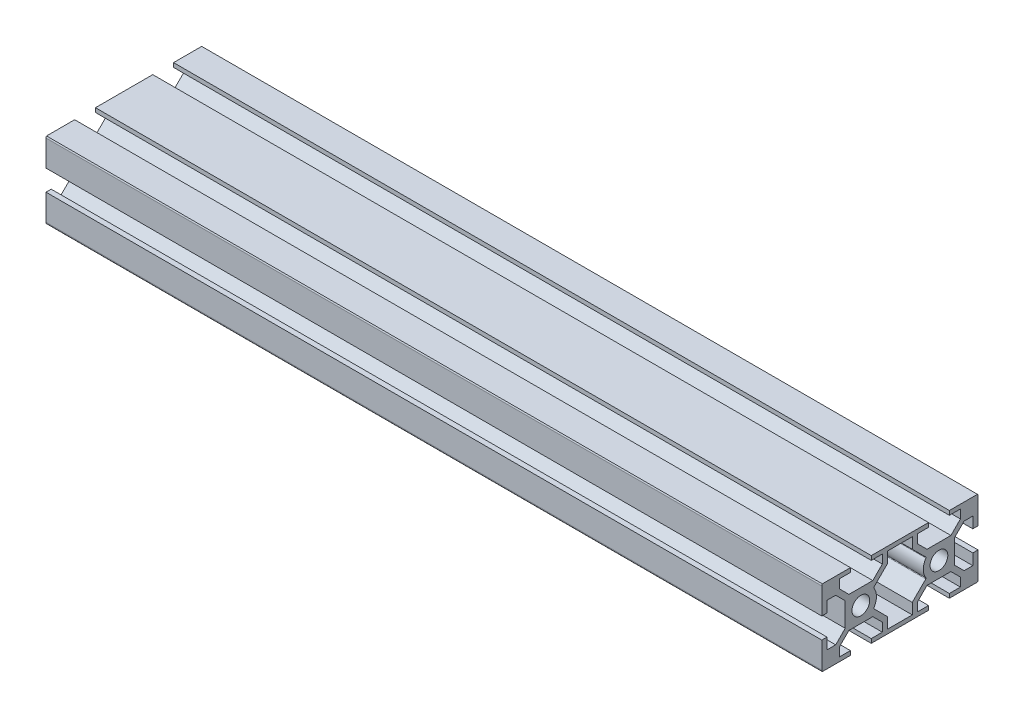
ISO-10303-21;
HEADER;
FILE_DESCRIPTION(('STEP AP214'),'2;1');
FILE_NAME('part.step','',(''),(''),'','','');
FILE_SCHEMA(('AUTOMOTIVE_DESIGN { 1 0 10303 214 1 1 1 1 }'));
ENDSEC;
DATA;
#1=APPLICATION_CONTEXT('core data for automotive mechanical design processes');
#2=APPLICATION_PROTOCOL_DEFINITION('international standard','automotive_design',2000,#1);
#3=PRODUCT_CONTEXT('',#1,'mechanical');
#4=PRODUCT('Part','Part','',(#3));
#5=PRODUCT_RELATED_PRODUCT_CATEGORY('part','',(#4));
#6=PRODUCT_DEFINITION_FORMATION('','',#4);
#7=PRODUCT_DEFINITION_CONTEXT('part definition',#1,'design');
#8=PRODUCT_DEFINITION('design','',#6,#7);
#9=PRODUCT_DEFINITION_SHAPE('','',#8);
#10=(LENGTH_UNIT() NAMED_UNIT(*) SI_UNIT(.MILLI.,.METRE.));
#11=(NAMED_UNIT(*) PLANE_ANGLE_UNIT() SI_UNIT($,.RADIAN.));
#12=(NAMED_UNIT(*) SI_UNIT($,.STERADIAN.) SOLID_ANGLE_UNIT());
#13=UNCERTAINTY_MEASURE_WITH_UNIT(LENGTH_MEASURE(1.E-05),#10,'distance_accuracy_value','');
#14=(GEOMETRIC_REPRESENTATION_CONTEXT(3) GLOBAL_UNCERTAINTY_ASSIGNED_CONTEXT((#13)) GLOBAL_UNIT_ASSIGNED_CONTEXT((#10,
#11,#12)) REPRESENTATION_CONTEXT('',''));
#15=CARTESIAN_POINT('',(0.,0.,0.));
#16=DIRECTION('',(0.,0.,1.));
#17=DIRECTION('',(1.,0.,0.));
#18=AXIS2_PLACEMENT_3D('',#15,#16,#17);
#19=CARTESIAN_POINT('',(298.,14.,29.0000000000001));
#20=DIRECTION('',(1.,0.,0.));
#21=DIRECTION('',(0.,0.,-1.));
#22=AXIS2_PLACEMENT_3D('',#19,#20,#21);
#23=PLANE('',#22);
#24=CARTESIAN_POINT('',(298.,0.,15.));
#25=DIRECTION('',(1.,0.,0.));
#26=DIRECTION('',(0.,0.,-1.));
#27=AXIS2_PLACEMENT_3D('',#24,#25,#26);
#28=CIRCLE('',#27,3.4);
#29=CARTESIAN_POINT('',(298.,0.,11.6));
#30=VERTEX_POINT('',#29);
#31=EDGE_CURVE('E614',#30,#30,#28,.T.);
#32=ORIENTED_EDGE('',*,*,#31,.F.);
#33=EDGE_LOOP('',(#32));
#34=FACE_BOUND('',#33,.T.);
#35=CARTESIAN_POINT('',(298.,14.,29.0000000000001));
#36=DIRECTION('',(1.,0.,0.));
#37=DIRECTION('',(0.,0.,-1.));
#38=AXIS2_PLACEMENT_3D('',#35,#36,#37);
#39=CIRCLE('',#38,0.999999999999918);
#40=CARTESIAN_POINT('',(298.,14.6,29.8));
#41=VERTEX_POINT('',#40);
#42=CARTESIAN_POINT('',(298.,14.,30.));
#43=VERTEX_POINT('',#42);
#44=EDGE_CURVE('E684',#41,#43,#39,.T.);
#45=ORIENTED_EDGE('',*,*,#44,.T.);
#46=DIRECTION('',(0.,-1.,0.));
#47=VECTOR('',#46,1.);
#48=CARTESIAN_POINT('',(298.,14.,30.));
#49=LINE('',#48,#47);
#50=CARTESIAN_POINT('',(298.,4.00000000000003,30.));
#51=VERTEX_POINT('',#50);
#52=EDGE_CURVE('E687',#43,#51,#49,.T.);
#53=ORIENTED_EDGE('',*,*,#52,.T.);
#54=DIRECTION('',(0.,0.,-1.));
#55=VECTOR('',#54,1.);
#56=CARTESIAN_POINT('',(298.,4.00000000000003,30.));
#57=LINE('',#56,#55);
#58=CARTESIAN_POINT('',(298.,4.00000000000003,28.));
#59=VERTEX_POINT('',#58);
#60=EDGE_CURVE('E690',#51,#59,#57,.T.);
#61=ORIENTED_EDGE('',*,*,#60,.T.);
#62=DIRECTION('',(0.,1.,0.));
#63=VECTOR('',#62,1.);
#64=CARTESIAN_POINT('',(298.,4.00000000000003,28.));
#65=LINE('',#64,#63);
#66=CARTESIAN_POINT('',(298.,8.24999999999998,28.));
#67=VERTEX_POINT('',#66);
#68=EDGE_CURVE('E692',#59,#67,#65,.T.);
#69=ORIENTED_EDGE('',*,*,#68,.T.);
#70=DIRECTION('',(0.,0.,-1.));
#71=VECTOR('',#70,1.);
#72=CARTESIAN_POINT('',(298.,8.24999999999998,28.));
#73=LINE('',#72,#71);
#74=CARTESIAN_POINT('',(298.,8.24999999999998,24.6642135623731));
#75=VERTEX_POINT('',#74);
#76=EDGE_CURVE('E694',#67,#75,#73,.T.);
#77=ORIENTED_EDGE('',*,*,#76,.T.);
#78=DIRECTION('',(0.,-0.707106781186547,-0.707106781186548));
#79=VECTOR('',#78,1.);
#80=CARTESIAN_POINT('',(298.,8.24999999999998,24.6642135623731));
#81=LINE('',#80,#79);
#82=CARTESIAN_POINT('',(298.,4.5857864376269,21.));
#83=VERTEX_POINT('',#82);
#84=EDGE_CURVE('E696',#75,#83,#81,.T.);
#85=ORIENTED_EDGE('',*,*,#84,.T.);
#86=DIRECTION('',(0.,-1.,0.));
#87=VECTOR('',#86,1.);
#88=CARTESIAN_POINT('',(298.,4.5857864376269,21.));
#89=LINE('',#88,#87);
#90=CARTESIAN_POINT('',(298.,-4.58578643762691,21.));
#91=VERTEX_POINT('',#90);
#92=EDGE_CURVE('E698',#83,#91,#89,.T.);
#93=ORIENTED_EDGE('',*,*,#92,.T.);
#94=DIRECTION('',(0.,-0.707106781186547,0.707106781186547));
#95=VECTOR('',#94,1.);
#96=CARTESIAN_POINT('',(298.,-4.58578643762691,21.));
#97=LINE('',#96,#95);
#98=CARTESIAN_POINT('',(298.,-8.25,24.6642135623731));
#99=VERTEX_POINT('',#98);
#100=EDGE_CURVE('E700',#91,#99,#97,.T.);
#101=ORIENTED_EDGE('',*,*,#100,.T.);
#102=DIRECTION('',(0.,0.,1.));
#103=VECTOR('',#102,1.);
#104=CARTESIAN_POINT('',(298.,-8.25,24.6642135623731));
#105=LINE('',#104,#103);
#106=CARTESIAN_POINT('',(298.,-8.25,28.));
#107=VERTEX_POINT('',#106);
#108=EDGE_CURVE('E702',#99,#107,#105,.T.);
#109=ORIENTED_EDGE('',*,*,#108,.T.);
#110=DIRECTION('',(0.,1.,0.));
#111=VECTOR('',#110,1.);
#112=CARTESIAN_POINT('',(298.,-8.25,28.));
#113=LINE('',#112,#111);
#114=CARTESIAN_POINT('',(298.,-4.00000000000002,28.));
#115=VERTEX_POINT('',#114);
#116=EDGE_CURVE('E704',#107,#115,#113,.T.);
#117=ORIENTED_EDGE('',*,*,#116,.T.);
#118=DIRECTION('',(0.,0.,1.));
#119=VECTOR('',#118,1.);
#120=CARTESIAN_POINT('',(298.,-4.00000000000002,28.));
#121=LINE('',#120,#119);
#122=CARTESIAN_POINT('',(298.,-4.00000000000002,30.));
#123=VERTEX_POINT('',#122);
#124=EDGE_CURVE('E706',#115,#123,#121,.T.);
#125=ORIENTED_EDGE('',*,*,#124,.T.);
#126=DIRECTION('',(0.,-1.,0.));
#127=VECTOR('',#126,1.);
#128=CARTESIAN_POINT('',(298.,-4.00000000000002,30.));
#129=LINE('',#128,#127);
#130=CARTESIAN_POINT('',(298.,-14.,30.));
#131=VERTEX_POINT('',#130);
#132=EDGE_CURVE('E708',#123,#131,#129,.T.);
#133=ORIENTED_EDGE('',*,*,#132,.T.);
#134=CARTESIAN_POINT('',(298.,-14.,29.));
#135=DIRECTION('',(1.,0.,0.));
#136=DIRECTION('',(0.,0.,-1.));
#137=AXIS2_PLACEMENT_3D('',#134,#135,#136);
#138=CIRCLE('',#137,0.99999999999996);
#139=CARTESIAN_POINT('',(298.,-14.6,29.8));
#140=VERTEX_POINT('',#139);
#141=EDGE_CURVE('E710',#131,#140,#138,.T.);
#142=ORIENTED_EDGE('',*,*,#141,.T.);
#143=DIRECTION('',(0.,0.,-1.));
#144=VECTOR('',#143,1.);
#145=CARTESIAN_POINT('',(298.,-14.6,29.8));
#146=LINE('',#145,#144);
#147=CARTESIAN_POINT('',(298.,-14.6,19.));
#148=VERTEX_POINT('',#147);
#149=EDGE_CURVE('E712',#140,#148,#146,.T.);
#150=ORIENTED_EDGE('',*,*,#149,.T.);
#151=DIRECTION('',(0.,1.,0.));
#152=VECTOR('',#151,1.);
#153=CARTESIAN_POINT('',(298.,-14.6,19.));
#154=LINE('',#153,#152);
#155=CARTESIAN_POINT('',(298.,-13.,19.));
#156=VERTEX_POINT('',#155);
#157=EDGE_CURVE('E714',#148,#156,#154,.T.);
#158=ORIENTED_EDGE('',*,*,#157,.T.);
#159=DIRECTION('',(0.,0.,1.));
#160=VECTOR('',#159,1.);
#161=CARTESIAN_POINT('',(298.,-13.,19.));
#162=LINE('',#161,#160);
#163=CARTESIAN_POINT('',(298.,-13.,23.25));
#164=VERTEX_POINT('',#163);
#165=EDGE_CURVE('E716',#156,#164,#162,.T.);
#166=ORIENTED_EDGE('',*,*,#165,.T.);
#167=DIRECTION('',(0.,1.,0.));
#168=VECTOR('',#167,1.);
#169=CARTESIAN_POINT('',(298.,-13.,23.25));
#170=LINE('',#169,#168);
#171=CARTESIAN_POINT('',(298.,-9.66421356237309,23.25));
#172=VERTEX_POINT('',#171);
#173=EDGE_CURVE('E718',#164,#172,#170,.T.);
#174=ORIENTED_EDGE('',*,*,#173,.T.);
#175=DIRECTION('',(0.,0.707106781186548,-0.707106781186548));
#176=VECTOR('',#175,1.);
#177=CARTESIAN_POINT('',(298.,-9.66421356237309,23.25));
#178=LINE('',#177,#176);
#179=CARTESIAN_POINT('',(298.,-6.,19.5857864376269));
#180=VERTEX_POINT('',#179);
#181=EDGE_CURVE('E720',#172,#180,#178,.T.);
#182=ORIENTED_EDGE('',*,*,#181,.T.);
#183=DIRECTION('',(0.,0.,-1.));
#184=VECTOR('',#183,1.);
#185=CARTESIAN_POINT('',(298.,-6.,19.5857864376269));
#186=LINE('',#185,#184);
#187=CARTESIAN_POINT('',(298.,-6.,10.4142135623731));
#188=VERTEX_POINT('',#187);
#189=EDGE_CURVE('E722',#180,#188,#186,.T.);
#190=ORIENTED_EDGE('',*,*,#189,.T.);
#191=DIRECTION('',(0.,-0.707106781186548,-0.707106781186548));
#192=VECTOR('',#191,1.);
#193=CARTESIAN_POINT('',(298.,-6.,10.4142135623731));
#194=LINE('',#193,#192);
#195=CARTESIAN_POINT('',(298.,-9.66421356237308,6.75));
#196=VERTEX_POINT('',#195);
#197=EDGE_CURVE('E724',#188,#196,#194,.T.);
#198=ORIENTED_EDGE('',*,*,#197,.T.);
#199=DIRECTION('',(0.,-1.,0.));
#200=VECTOR('',#199,1.);
#201=CARTESIAN_POINT('',(298.,-9.66421356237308,6.75));
#202=LINE('',#201,#200);
#203=CARTESIAN_POINT('',(298.,-13.,6.75));
#204=VERTEX_POINT('',#203);
#205=EDGE_CURVE('E726',#196,#204,#202,.T.);
#206=ORIENTED_EDGE('',*,*,#205,.T.);
#207=DIRECTION('',(0.,0.,1.));
#208=VECTOR('',#207,1.);
#209=CARTESIAN_POINT('',(298.,-13.,6.75));
#210=LINE('',#209,#208);
#211=CARTESIAN_POINT('',(298.,-13.,11.));
#212=VERTEX_POINT('',#211);
#213=EDGE_CURVE('E728',#204,#212,#210,.T.);
#214=ORIENTED_EDGE('',*,*,#213,.T.);
#215=DIRECTION('',(0.,-1.,0.));
#216=VECTOR('',#215,1.);
#217=CARTESIAN_POINT('',(298.,-13.,11.));
#218=LINE('',#217,#216);
#219=CARTESIAN_POINT('',(298.,-14.6,11.));
#220=VERTEX_POINT('',#219);
#221=EDGE_CURVE('E730',#212,#220,#218,.T.);
#222=ORIENTED_EDGE('',*,*,#221,.T.);
#223=DIRECTION('',(0.,0.,-1.));
#224=VECTOR('',#223,1.);
#225=CARTESIAN_POINT('',(298.,-14.6,11.));
#226=LINE('',#225,#224);
#227=CARTESIAN_POINT('',(298.,-14.6,-11.));
#228=VERTEX_POINT('',#227);
#229=EDGE_CURVE('E732',#220,#228,#226,.T.);
#230=ORIENTED_EDGE('',*,*,#229,.T.);
#231=DIRECTION('',(0.,1.,0.));
#232=VECTOR('',#231,1.);
#233=CARTESIAN_POINT('',(298.,-14.6,-11.));
#234=LINE('',#233,#232);
#235=CARTESIAN_POINT('',(298.,-13.,-11.));
#236=VERTEX_POINT('',#235);
#237=EDGE_CURVE('E734',#228,#236,#234,.T.);
#238=ORIENTED_EDGE('',*,*,#237,.T.);
#239=DIRECTION('',(0.,0.,1.));
#240=VECTOR('',#239,1.);
#241=CARTESIAN_POINT('',(298.,-13.,-11.));
#242=LINE('',#241,#240);
#243=CARTESIAN_POINT('',(298.,-13.,-6.75));
#244=VERTEX_POINT('',#243);
#245=EDGE_CURVE('E736',#236,#244,#242,.T.);
#246=ORIENTED_EDGE('',*,*,#245,.T.);
#247=DIRECTION('',(0.,1.,0.));
#248=VECTOR('',#247,1.);
#249=CARTESIAN_POINT('',(298.,-13.,-6.75));
#250=LINE('',#249,#248);
#251=CARTESIAN_POINT('',(298.,-9.6642135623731,-6.75));
#252=VERTEX_POINT('',#251);
#253=EDGE_CURVE('E738',#244,#252,#250,.T.);
#254=ORIENTED_EDGE('',*,*,#253,.T.);
#255=DIRECTION('',(0.,0.707106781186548,-0.707106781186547));
#256=VECTOR('',#255,1.);
#257=CARTESIAN_POINT('',(298.,-9.6642135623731,-6.75));
#258=LINE('',#257,#256);
#259=CARTESIAN_POINT('',(298.,-6.,-10.4142135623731));
#260=VERTEX_POINT('',#259);
#261=EDGE_CURVE('E740',#252,#260,#258,.T.);
#262=ORIENTED_EDGE('',*,*,#261,.T.);
#263=DIRECTION('',(0.,0.,-1.));
#264=VECTOR('',#263,1.);
#265=CARTESIAN_POINT('',(298.,-6.,-10.4142135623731));
#266=LINE('',#265,#264);
#267=CARTESIAN_POINT('',(298.,-6.,-19.5857864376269));
#268=VERTEX_POINT('',#267);
#269=EDGE_CURVE('E742',#260,#268,#266,.T.);
#270=ORIENTED_EDGE('',*,*,#269,.T.);
#271=DIRECTION('',(0.,-0.707106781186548,-0.707106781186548));
#272=VECTOR('',#271,1.);
#273=CARTESIAN_POINT('',(298.,-6.,-19.5857864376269));
#274=LINE('',#273,#272);
#275=CARTESIAN_POINT('',(298.,-9.66421356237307,-23.25));
#276=VERTEX_POINT('',#275);
#277=EDGE_CURVE('E744',#268,#276,#274,.T.);
#278=ORIENTED_EDGE('',*,*,#277,.T.);
#279=DIRECTION('',(0.,-1.,0.));
#280=VECTOR('',#279,1.);
#281=CARTESIAN_POINT('',(298.,-9.66421356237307,-23.25));
#282=LINE('',#281,#280);
#283=CARTESIAN_POINT('',(298.,-13.,-23.25));
#284=VERTEX_POINT('',#283);
#285=EDGE_CURVE('E746',#276,#284,#282,.T.);
#286=ORIENTED_EDGE('',*,*,#285,.T.);
#287=DIRECTION('',(0.,0.,1.));
#288=VECTOR('',#287,1.);
#289=CARTESIAN_POINT('',(298.,-13.,-23.25));
#290=LINE('',#289,#288);
#291=CARTESIAN_POINT('',(298.,-13.,-19.));
#292=VERTEX_POINT('',#291);
#293=EDGE_CURVE('E748',#284,#292,#290,.T.);
#294=ORIENTED_EDGE('',*,*,#293,.T.);
#295=DIRECTION('',(0.,-1.,0.));
#296=VECTOR('',#295,1.);
#297=CARTESIAN_POINT('',(298.,-13.,-19.));
#298=LINE('',#297,#296);
#299=CARTESIAN_POINT('',(298.,-14.6,-19.));
#300=VERTEX_POINT('',#299);
#301=EDGE_CURVE('E750',#292,#300,#298,.T.);
#302=ORIENTED_EDGE('',*,*,#301,.T.);
#303=DIRECTION('',(0.,0.,-1.));
#304=VECTOR('',#303,1.);
#305=CARTESIAN_POINT('',(298.,-14.6,-19.));
#306=LINE('',#305,#304);
#307=CARTESIAN_POINT('',(298.,-14.6,-29.8));
#308=VERTEX_POINT('',#307);
#309=EDGE_CURVE('E752',#300,#308,#306,.T.);
#310=ORIENTED_EDGE('',*,*,#309,.T.);
#311=CARTESIAN_POINT('',(298.,-14.,-29.));
#312=DIRECTION('',(1.,0.,0.));
#313=DIRECTION('',(0.,0.,-1.));
#314=AXIS2_PLACEMENT_3D('',#311,#312,#313);
#315=CIRCLE('',#314,0.999999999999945);
#316=CARTESIAN_POINT('',(298.,-14.,-30.));
#317=VERTEX_POINT('',#316);
#318=EDGE_CURVE('E754',#308,#317,#315,.T.);
#319=ORIENTED_EDGE('',*,*,#318,.T.);
#320=DIRECTION('',(0.,1.,0.));
#321=VECTOR('',#320,1.);
#322=CARTESIAN_POINT('',(298.,-14.,-30.));
#323=LINE('',#322,#321);
#324=CARTESIAN_POINT('',(298.,-4.00000000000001,-30.));
#325=VERTEX_POINT('',#324);
#326=EDGE_CURVE('E756',#317,#325,#323,.T.);
#327=ORIENTED_EDGE('',*,*,#326,.T.);
#328=DIRECTION('',(0.,0.,1.));
#329=VECTOR('',#328,1.);
#330=CARTESIAN_POINT('',(298.,-4.00000000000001,-30.));
#331=LINE('',#330,#329);
#332=CARTESIAN_POINT('',(298.,-4.00000000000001,-28.));
#333=VERTEX_POINT('',#332);
#334=EDGE_CURVE('E758',#325,#333,#331,.T.);
#335=ORIENTED_EDGE('',*,*,#334,.T.);
#336=DIRECTION('',(0.,-1.,0.));
#337=VECTOR('',#336,1.);
#338=CARTESIAN_POINT('',(298.,-4.00000000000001,-28.));
#339=LINE('',#338,#337);
#340=CARTESIAN_POINT('',(298.,-8.24999999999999,-28.));
#341=VERTEX_POINT('',#340);
#342=EDGE_CURVE('E760',#333,#341,#339,.T.);
#343=ORIENTED_EDGE('',*,*,#342,.T.);
#344=DIRECTION('',(0.,0.,1.));
#345=VECTOR('',#344,1.);
#346=CARTESIAN_POINT('',(298.,-8.24999999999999,-28.));
#347=LINE('',#346,#345);
#348=CARTESIAN_POINT('',(298.,-8.24999999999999,-24.6642135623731));
#349=VERTEX_POINT('',#348);
#350=EDGE_CURVE('E762',#341,#349,#347,.T.);
#351=ORIENTED_EDGE('',*,*,#350,.T.);
#352=DIRECTION('',(0.,0.707106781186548,0.707106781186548));
#353=VECTOR('',#352,1.);
#354=CARTESIAN_POINT('',(298.,-8.24999999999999,-24.6642135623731));
#355=LINE('',#354,#353);
#356=CARTESIAN_POINT('',(298.,-4.58578643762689,-21.));
#357=VERTEX_POINT('',#356);
#358=EDGE_CURVE('E764',#349,#357,#355,.T.);
#359=ORIENTED_EDGE('',*,*,#358,.T.);
#360=DIRECTION('',(0.,1.,0.));
#361=VECTOR('',#360,1.);
#362=CARTESIAN_POINT('',(298.,-4.58578643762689,-21.));
#363=LINE('',#362,#361);
#364=CARTESIAN_POINT('',(298.,4.5857864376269,-21.));
#365=VERTEX_POINT('',#364);
#366=EDGE_CURVE('E766',#357,#365,#363,.T.);
#367=ORIENTED_EDGE('',*,*,#366,.T.);
#368=DIRECTION('',(0.,0.707106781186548,-0.707106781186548));
#369=VECTOR('',#368,1.);
#370=CARTESIAN_POINT('',(298.,4.5857864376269,-21.));
#371=LINE('',#370,#369);
#372=CARTESIAN_POINT('',(298.,8.25,-24.6642135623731));
#373=VERTEX_POINT('',#372);
#374=EDGE_CURVE('E768',#365,#373,#371,.T.);
#375=ORIENTED_EDGE('',*,*,#374,.T.);
#376=DIRECTION('',(0.,0.,-1.));
#377=VECTOR('',#376,1.);
#378=CARTESIAN_POINT('',(298.,8.25,-24.6642135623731));
#379=LINE('',#378,#377);
#380=CARTESIAN_POINT('',(298.,8.25,-28.));
#381=VERTEX_POINT('',#380);
#382=EDGE_CURVE('E770',#373,#381,#379,.T.);
#383=ORIENTED_EDGE('',*,*,#382,.T.);
#384=DIRECTION('',(0.,-1.,0.));
#385=VECTOR('',#384,1.);
#386=CARTESIAN_POINT('',(298.,8.25,-28.));
#387=LINE('',#386,#385);
#388=CARTESIAN_POINT('',(298.,4.00000000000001,-28.));
#389=VERTEX_POINT('',#388);
#390=EDGE_CURVE('E772',#381,#389,#387,.T.);
#391=ORIENTED_EDGE('',*,*,#390,.T.);
#392=DIRECTION('',(0.,0.,-1.));
#393=VECTOR('',#392,1.);
#394=CARTESIAN_POINT('',(298.,4.00000000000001,-28.));
#395=LINE('',#394,#393);
#396=CARTESIAN_POINT('',(298.,4.00000000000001,-30.));
#397=VERTEX_POINT('',#396);
#398=EDGE_CURVE('E774',#389,#397,#395,.T.);
#399=ORIENTED_EDGE('',*,*,#398,.T.);
#400=DIRECTION('',(0.,1.,0.));
#401=VECTOR('',#400,1.);
#402=CARTESIAN_POINT('',(298.,4.00000000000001,-30.));
#403=LINE('',#402,#401);
#404=CARTESIAN_POINT('',(298.,14.,-30.));
#405=VERTEX_POINT('',#404);
#406=EDGE_CURVE('E776',#397,#405,#403,.T.);
#407=ORIENTED_EDGE('',*,*,#406,.T.);
#408=CARTESIAN_POINT('',(298.,14.,-29.));
#409=DIRECTION('',(1.,0.,0.));
#410=DIRECTION('',(0.,0.,-1.));
#411=AXIS2_PLACEMENT_3D('',#408,#409,#410);
#412=CIRCLE('',#411,0.999999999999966);
#413=CARTESIAN_POINT('',(298.,14.6,-29.8));
#414=VERTEX_POINT('',#413);
#415=EDGE_CURVE('E778',#405,#414,#412,.T.);
#416=ORIENTED_EDGE('',*,*,#415,.T.);
#417=DIRECTION('',(0.,0.,1.));
#418=VECTOR('',#417,1.);
#419=CARTESIAN_POINT('',(298.,14.6,-29.8));
#420=LINE('',#419,#418);
#421=CARTESIAN_POINT('',(298.,14.6,-19.));
#422=VERTEX_POINT('',#421);
#423=EDGE_CURVE('E780',#414,#422,#420,.T.);
#424=ORIENTED_EDGE('',*,*,#423,.T.);
#425=DIRECTION('',(0.,-1.,0.));
#426=VECTOR('',#425,1.);
#427=CARTESIAN_POINT('',(298.,14.6,-19.));
#428=LINE('',#427,#426);
#429=CARTESIAN_POINT('',(298.,13.,-19.));
#430=VERTEX_POINT('',#429);
#431=EDGE_CURVE('E782',#422,#430,#428,.T.);
#432=ORIENTED_EDGE('',*,*,#431,.T.);
#433=DIRECTION('',(0.,0.,-1.));
#434=VECTOR('',#433,1.);
#435=CARTESIAN_POINT('',(298.,13.,-19.));
#436=LINE('',#435,#434);
#437=CARTESIAN_POINT('',(298.,13.,-23.25));
#438=VERTEX_POINT('',#437);
#439=EDGE_CURVE('E784',#430,#438,#436,.T.);
#440=ORIENTED_EDGE('',*,*,#439,.T.);
#441=DIRECTION('',(0.,-1.,0.));
#442=VECTOR('',#441,1.);
#443=CARTESIAN_POINT('',(298.,13.,-23.25));
#444=LINE('',#443,#442);
#445=CARTESIAN_POINT('',(298.,9.66421356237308,-23.25));
#446=VERTEX_POINT('',#445);
#447=EDGE_CURVE('E786',#438,#446,#444,.T.);
#448=ORIENTED_EDGE('',*,*,#447,.T.);
#449=DIRECTION('',(0.,-0.707106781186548,0.707106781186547));
#450=VECTOR('',#449,1.);
#451=CARTESIAN_POINT('',(298.,9.66421356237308,-23.25));
#452=LINE('',#451,#450);
#453=CARTESIAN_POINT('',(298.,6.,-19.5857864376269));
#454=VERTEX_POINT('',#453);
#455=EDGE_CURVE('E788',#446,#454,#452,.T.);
#456=ORIENTED_EDGE('',*,*,#455,.T.);
#457=DIRECTION('',(0.,0.,1.));
#458=VECTOR('',#457,1.);
#459=CARTESIAN_POINT('',(298.,6.,-19.5857864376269));
#460=LINE('',#459,#458);
#461=CARTESIAN_POINT('',(298.,6.,-10.4142135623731));
#462=VERTEX_POINT('',#461);
#463=EDGE_CURVE('E790',#454,#462,#460,.T.);
#464=ORIENTED_EDGE('',*,*,#463,.T.);
#465=DIRECTION('',(0.,0.707106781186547,0.707106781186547));
#466=VECTOR('',#465,1.);
#467=CARTESIAN_POINT('',(298.,6.,-10.4142135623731));
#468=LINE('',#467,#466);
#469=CARTESIAN_POINT('',(298.,9.6642135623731,-6.75));
#470=VERTEX_POINT('',#469);
#471=EDGE_CURVE('E792',#462,#470,#468,.T.);
#472=ORIENTED_EDGE('',*,*,#471,.T.);
#473=DIRECTION('',(0.,1.,0.));
#474=VECTOR('',#473,1.);
#475=CARTESIAN_POINT('',(298.,9.6642135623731,-6.75));
#476=LINE('',#475,#474);
#477=CARTESIAN_POINT('',(298.,13.,-6.75));
#478=VERTEX_POINT('',#477);
#479=EDGE_CURVE('E794',#470,#478,#476,.T.);
#480=ORIENTED_EDGE('',*,*,#479,.T.);
#481=DIRECTION('',(0.,0.,-1.));
#482=VECTOR('',#481,1.);
#483=CARTESIAN_POINT('',(298.,13.,-6.75));
#484=LINE('',#483,#482);
#485=CARTESIAN_POINT('',(298.,13.,-11.));
#486=VERTEX_POINT('',#485);
#487=EDGE_CURVE('E796',#478,#486,#484,.T.);
#488=ORIENTED_EDGE('',*,*,#487,.T.);
#489=DIRECTION('',(0.,1.,0.));
#490=VECTOR('',#489,1.);
#491=CARTESIAN_POINT('',(298.,13.,-11.));
#492=LINE('',#491,#490);
#493=CARTESIAN_POINT('',(298.,14.6,-11.));
#494=VERTEX_POINT('',#493);
#495=EDGE_CURVE('E798',#486,#494,#492,.T.);
#496=ORIENTED_EDGE('',*,*,#495,.T.);
#497=DIRECTION('',(0.,0.,1.));
#498=VECTOR('',#497,1.);
#499=CARTESIAN_POINT('',(298.,14.6,-11.));
#500=LINE('',#499,#498);
#501=CARTESIAN_POINT('',(298.,14.6,11.));
#502=VERTEX_POINT('',#501);
#503=EDGE_CURVE('E800',#494,#502,#500,.T.);
#504=ORIENTED_EDGE('',*,*,#503,.T.);
#505=DIRECTION('',(0.,-1.,0.));
#506=VECTOR('',#505,1.);
#507=CARTESIAN_POINT('',(298.,14.6,11.));
#508=LINE('',#507,#506);
#509=CARTESIAN_POINT('',(298.,13.,11.));
#510=VERTEX_POINT('',#509);
#511=EDGE_CURVE('E802',#502,#510,#508,.T.);
#512=ORIENTED_EDGE('',*,*,#511,.T.);
#513=DIRECTION('',(0.,0.,-1.));
#514=VECTOR('',#513,1.);
#515=CARTESIAN_POINT('',(298.,13.,11.));
#516=LINE('',#515,#514);
#517=CARTESIAN_POINT('',(298.,13.,6.75));
#518=VERTEX_POINT('',#517);
#519=EDGE_CURVE('E804',#510,#518,#516,.T.);
#520=ORIENTED_EDGE('',*,*,#519,.T.);
#521=DIRECTION('',(0.,-1.,0.));
#522=VECTOR('',#521,1.);
#523=CARTESIAN_POINT('',(298.,13.,6.75));
#524=LINE('',#523,#522);
#525=CARTESIAN_POINT('',(298.,9.66421356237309,6.75));
#526=VERTEX_POINT('',#525);
#527=EDGE_CURVE('E806',#518,#526,#524,.T.);
#528=ORIENTED_EDGE('',*,*,#527,.T.);
#529=DIRECTION('',(0.,-0.707106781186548,0.707106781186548));
#530=VECTOR('',#529,1.);
#531=CARTESIAN_POINT('',(298.,9.66421356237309,6.75));
#532=LINE('',#531,#530);
#533=CARTESIAN_POINT('',(298.,6.,10.4142135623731));
#534=VERTEX_POINT('',#533);
#535=EDGE_CURVE('E808',#526,#534,#532,.T.);
#536=ORIENTED_EDGE('',*,*,#535,.T.);
#537=DIRECTION('',(0.,0.,1.));
#538=VECTOR('',#537,1.);
#539=CARTESIAN_POINT('',(298.,6.,10.4142135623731));
#540=LINE('',#539,#538);
#541=CARTESIAN_POINT('',(298.,6.,19.5857864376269));
#542=VERTEX_POINT('',#541);
#543=EDGE_CURVE('E810',#534,#542,#540,.T.);
#544=ORIENTED_EDGE('',*,*,#543,.T.);
#545=DIRECTION('',(0.,0.707106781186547,0.707106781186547));
#546=VECTOR('',#545,1.);
#547=CARTESIAN_POINT('',(298.,6.,19.5857864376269));
#548=LINE('',#547,#546);
#549=CARTESIAN_POINT('',(298.,9.66421356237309,23.25));
#550=VERTEX_POINT('',#549);
#551=EDGE_CURVE('E812',#542,#550,#548,.T.);
#552=ORIENTED_EDGE('',*,*,#551,.T.);
#553=DIRECTION('',(0.,1.,0.));
#554=VECTOR('',#553,1.);
#555=CARTESIAN_POINT('',(298.,9.66421356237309,23.25));
#556=LINE('',#555,#554);
#557=CARTESIAN_POINT('',(298.,13.,23.25));
#558=VERTEX_POINT('',#557);
#559=EDGE_CURVE('E814',#550,#558,#556,.T.);
#560=ORIENTED_EDGE('',*,*,#559,.T.);
#561=DIRECTION('',(0.,0.,-1.));
#562=VECTOR('',#561,1.);
#563=CARTESIAN_POINT('',(298.,13.,23.25));
#564=LINE('',#563,#562);
#565=CARTESIAN_POINT('',(298.,13.,19.));
#566=VERTEX_POINT('',#565);
#567=EDGE_CURVE('E816',#558,#566,#564,.T.);
#568=ORIENTED_EDGE('',*,*,#567,.T.);
#569=DIRECTION('',(0.,1.,0.));
#570=VECTOR('',#569,1.);
#571=CARTESIAN_POINT('',(298.,13.,19.));
#572=LINE('',#571,#570);
#573=CARTESIAN_POINT('',(298.,14.6,19.));
#574=VERTEX_POINT('',#573);
#575=EDGE_CURVE('E818',#566,#574,#572,.T.);
#576=ORIENTED_EDGE('',*,*,#575,.T.);
#577=DIRECTION('',(0.,0.,1.));
#578=VECTOR('',#577,1.);
#579=CARTESIAN_POINT('',(298.,14.6,19.));
#580=LINE('',#579,#578);
#581=EDGE_CURVE('E820',#574,#41,#580,.T.);
#582=ORIENTED_EDGE('',*,*,#581,.T.);
#583=EDGE_LOOP('',(#45,#53,#61,#69,#77,#85,#93,#101,#109,#117,#125,#133,#142,#150,#158,#166,
#174,#182,#190,#198,#206,#214,#222,#230,#238,#246,#254,#262,#270,#278,#286,#294,#302,#310,#319,
#327,#335,#343,#351,#359,#367,#375,#383,#391,#399,#407,#416,#424,#432,#440,#448,#456,#464,#472,
#480,#488,#496,#504,#512,#520,#528,#536,#544,#552,#560,#568,#576,#582));
#584=FACE_BOUND('',#583,.T.);
#585=CARTESIAN_POINT('',(298.,-3.43966012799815,9.72186224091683));
#586=DIRECTION('',(1.,0.,0.));
#587=DIRECTION('',(0.,0.,-1.));
#588=AXIS2_PLACEMENT_3D('',#585,#586,#587);
#589=CIRCLE('',#588,0.29999999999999);
#590=CARTESIAN_POINT('',(298.,-3.27586678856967,9.9732021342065));
#591=VERTEX_POINT('',#590);
#592=CARTESIAN_POINT('',(298.,-3.6517921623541,9.93399427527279));
#593=VERTEX_POINT('',#592);
#594=EDGE_CURVE('E568',#591,#593,#589,.T.);
#595=ORIENTED_EDGE('',*,*,#594,.F.);
#596=CARTESIAN_POINT('',(298.,0.,15.));
#597=DIRECTION('',(-1.,0.,0.));
#598=DIRECTION('',(0.,0.,-1.));
#599=AXIS2_PLACEMENT_3D('',#596,#597,#598);
#600=CIRCLE('',#599,6.);
#601=CARTESIAN_POINT('',(298.,3.27586678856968,9.9732021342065));
#602=VERTEX_POINT('',#601);
#603=EDGE_CURVE('E560',#602,#591,#600,.T.);
#604=ORIENTED_EDGE('',*,*,#603,.F.);
#605=CARTESIAN_POINT('',(298.,3.43966012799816,9.72186224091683));
#606=DIRECTION('',(1.,0.,0.));
#607=DIRECTION('',(0.,0.,-1.));
#608=AXIS2_PLACEMENT_3D('',#605,#606,#607);
#609=CIRCLE('',#608,0.299999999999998);
#610=CARTESIAN_POINT('',(298.,3.65179216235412,9.93399427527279));
#611=VERTEX_POINT('',#610);
#612=EDGE_CURVE('E611',#611,#602,#609,.T.);
#613=ORIENTED_EDGE('',*,*,#612,.F.);
#614=DIRECTION('',(0.,-0.707106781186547,0.707106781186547));
#615=VECTOR('',#614,1.);
#616=CARTESIAN_POINT('',(298.,8.83578643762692,4.75));
#617=LINE('',#616,#615);
#618=CARTESIAN_POINT('',(298.,8.83578643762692,4.75));
#619=VERTEX_POINT('',#618);
#620=EDGE_CURVE('E609',#619,#611,#617,.T.);
#621=ORIENTED_EDGE('',*,*,#620,.F.);
#622=DIRECTION('',(0.,-1.,0.));
#623=VECTOR('',#622,1.);
#624=CARTESIAN_POINT('',(298.,13.,4.75000000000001));
#625=LINE('',#624,#623);
#626=CARTESIAN_POINT('',(298.,13.,4.75000000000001));
#627=VERTEX_POINT('',#626);
#628=EDGE_CURVE('E607',#627,#619,#625,.T.);
#629=ORIENTED_EDGE('',*,*,#628,.F.);
#630=DIRECTION('',(0.,0.,1.));
#631=VECTOR('',#630,1.);
#632=CARTESIAN_POINT('',(298.,13.,-4.75));
#633=LINE('',#632,#631);
#634=CARTESIAN_POINT('',(298.,13.,-4.75));
#635=VERTEX_POINT('',#634);
#636=EDGE_CURVE('E605',#635,#627,#633,.T.);
#637=ORIENTED_EDGE('',*,*,#636,.F.);
#638=DIRECTION('',(0.,1.,0.));
#639=VECTOR('',#638,1.);
#640=CARTESIAN_POINT('',(298.,8.83578643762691,-4.75));
#641=LINE('',#640,#639);
#642=CARTESIAN_POINT('',(298.,8.83578643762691,-4.75));
#643=VERTEX_POINT('',#642);
#644=EDGE_CURVE('E603',#643,#635,#641,.T.);
#645=ORIENTED_EDGE('',*,*,#644,.F.);
#646=DIRECTION('',(0.,0.707106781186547,0.707106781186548));
#647=VECTOR('',#646,1.);
#648=CARTESIAN_POINT('',(298.,3.65179216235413,-9.93399427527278));
#649=LINE('',#648,#647);
#650=CARTESIAN_POINT('',(298.,3.65179216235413,-9.93399427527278));
#651=VERTEX_POINT('',#650);
#652=EDGE_CURVE('E601',#651,#643,#649,.T.);
#653=ORIENTED_EDGE('',*,*,#652,.F.);
#654=CARTESIAN_POINT('',(298.,3.43966012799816,-9.72186224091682));
#655=DIRECTION('',(1.,0.,0.));
#656=DIRECTION('',(0.,0.,-1.));
#657=AXIS2_PLACEMENT_3D('',#654,#655,#656);
#658=CIRCLE('',#657,0.299999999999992);
#659=CARTESIAN_POINT('',(298.,3.27586678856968,-9.97320213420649));
#660=VERTEX_POINT('',#659);
#661=EDGE_CURVE('E599',#660,#651,#658,.T.);
#662=ORIENTED_EDGE('',*,*,#661,.F.);
#663=CARTESIAN_POINT('',(298.,0.,-15.));
#664=DIRECTION('',(-1.,0.,0.));
#665=DIRECTION('',(0.,0.,-1.));
#666=AXIS2_PLACEMENT_3D('',#663,#664,#665);
#667=CIRCLE('',#666,6.00000000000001);
#668=CARTESIAN_POINT('',(298.,-3.27586678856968,-9.97320213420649));
#669=VERTEX_POINT('',#668);
#670=EDGE_CURVE('E597',#669,#660,#667,.T.);
#671=ORIENTED_EDGE('',*,*,#670,.F.);
#672=CARTESIAN_POINT('',(298.,-3.43966012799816,-9.72186224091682));
#673=DIRECTION('',(1.,0.,0.));
#674=DIRECTION('',(0.,0.,-1.));
#675=AXIS2_PLACEMENT_3D('',#672,#673,#674);
#676=CIRCLE('',#675,0.299999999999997);
#677=CARTESIAN_POINT('',(298.,-3.65179216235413,-9.93399427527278));
#678=VERTEX_POINT('',#677);
#679=EDGE_CURVE('E595',#678,#669,#676,.T.);
#680=ORIENTED_EDGE('',*,*,#679,.F.);
#681=DIRECTION('',(0.,0.707106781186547,-0.707106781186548));
#682=VECTOR('',#681,1.);
#683=CARTESIAN_POINT('',(298.,-8.83578643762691,-4.75));
#684=LINE('',#683,#682);
#685=CARTESIAN_POINT('',(298.,-8.83578643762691,-4.75));
#686=VERTEX_POINT('',#685);
#687=EDGE_CURVE('E593',#686,#678,#684,.T.);
#688=ORIENTED_EDGE('',*,*,#687,.F.);
#689=DIRECTION('',(0.,1.,0.));
#690=VECTOR('',#689,1.);
#691=CARTESIAN_POINT('',(298.,-13.,-4.75));
#692=LINE('',#691,#690);
#693=CARTESIAN_POINT('',(298.,-13.,-4.75));
#694=VERTEX_POINT('',#693);
#695=EDGE_CURVE('E591',#694,#686,#692,.T.);
#696=ORIENTED_EDGE('',*,*,#695,.F.);
#697=DIRECTION('',(0.,0.,-1.));
#698=VECTOR('',#697,1.);
#699=CARTESIAN_POINT('',(298.,-13.,4.75));
#700=LINE('',#699,#698);
#701=CARTESIAN_POINT('',(298.,-13.,4.75));
#702=VERTEX_POINT('',#701);
#703=EDGE_CURVE('E589',#702,#694,#700,.T.);
#704=ORIENTED_EDGE('',*,*,#703,.F.);
#705=DIRECTION('',(0.,-1.,0.));
#706=VECTOR('',#705,1.);
#707=CARTESIAN_POINT('',(298.,-8.83578643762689,4.75));
#708=LINE('',#707,#706);
#709=CARTESIAN_POINT('',(298.,-8.83578643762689,4.75));
#710=VERTEX_POINT('',#709);
#711=EDGE_CURVE('E584',#710,#702,#708,.T.);
#712=ORIENTED_EDGE('',*,*,#711,.F.);
#713=DIRECTION('',(0.,-0.707106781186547,-0.707106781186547));
#714=VECTOR('',#713,1.);
#715=CARTESIAN_POINT('',(298.,-3.65179216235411,9.93399427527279));
#716=LINE('',#715,#714);
#717=EDGE_CURVE('E582',#593,#710,#716,.T.);
#718=ORIENTED_EDGE('',*,*,#717,.F.);
#719=EDGE_LOOP('',(#595,#604,#613,#621,#629,#637,#645,#653,#662,#671,#680,#688,#696,#704,#712,#718));
#720=FACE_BOUND('',#719,.T.);
#721=CARTESIAN_POINT('',(298.,0.,-15.));
#722=DIRECTION('',(1.,0.,0.));
#723=DIRECTION('',(0.,0.,-1.));
#724=AXIS2_PLACEMENT_3D('',#721,#722,#723);
#725=CIRCLE('',#724,3.39999999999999);
#726=CARTESIAN_POINT('',(298.,0.,-18.4));
#727=VERTEX_POINT('',#726);
#728=EDGE_CURVE('E2239',#727,#727,#725,.T.);
#729=ORIENTED_EDGE('',*,*,#728,.F.);
#730=EDGE_LOOP('',(#729));
#731=FACE_BOUND('',#730,.T.);
#732=ADVANCED_FACE('F39',(#34,#584,#720,#731),#23,.T.);
#733=CARTESIAN_POINT('',(0.,14.,29.0000000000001));
#734=DIRECTION('',(1.,0.,0.));
#735=DIRECTION('',(0.,0.,-1.));
#736=AXIS2_PLACEMENT_3D('',#733,#734,#735);
#737=PLANE('',#736);
#738=CARTESIAN_POINT('',(0.,14.,29.0000000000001));
#739=DIRECTION('',(1.,0.,0.));
#740=DIRECTION('',(0.,0.,-1.));
#741=AXIS2_PLACEMENT_3D('',#738,#739,#740);
#742=CIRCLE('',#741,0.999999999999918);
#743=CARTESIAN_POINT('',(0.,14.6,29.8));
#744=VERTEX_POINT('',#743);
#745=CARTESIAN_POINT('',(0.,14.,30.));
#746=VERTEX_POINT('',#745);
#747=EDGE_CURVE('E576',#744,#746,#742,.T.);
#748=ORIENTED_EDGE('',*,*,#747,.F.);
#749=DIRECTION('',(0.,0.,1.));
#750=VECTOR('',#749,1.);
#751=CARTESIAN_POINT('',(0.,14.6,19.));
#752=LINE('',#751,#750);
#753=CARTESIAN_POINT('',(0.,14.6,19.));
#754=VERTEX_POINT('',#753);
#755=EDGE_CURVE('E688',#754,#744,#752,.T.);
#756=ORIENTED_EDGE('',*,*,#755,.F.);
#757=DIRECTION('',(0.,1.,0.));
#758=VECTOR('',#757,1.);
#759=CARTESIAN_POINT('',(0.,13.,19.));
#760=LINE('',#759,#758);
#761=CARTESIAN_POINT('',(0.,13.,19.));
#762=VERTEX_POINT('',#761);
#763=EDGE_CURVE('E955',#762,#754,#760,.T.);
#764=ORIENTED_EDGE('',*,*,#763,.F.);
#765=DIRECTION('',(0.,0.,-1.));
#766=VECTOR('',#765,1.);
#767=CARTESIAN_POINT('',(0.,13.,23.25));
#768=LINE('',#767,#766);
#769=CARTESIAN_POINT('',(0.,13.,23.25));
#770=VERTEX_POINT('',#769);
#771=EDGE_CURVE('E953',#770,#762,#768,.T.);
#772=ORIENTED_EDGE('',*,*,#771,.F.);
#773=DIRECTION('',(0.,1.,0.));
#774=VECTOR('',#773,1.);
#775=CARTESIAN_POINT('',(0.,9.66421356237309,23.25));
#776=LINE('',#775,#774);
#777=CARTESIAN_POINT('',(0.,9.66421356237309,23.25));
#778=VERTEX_POINT('',#777);
#779=EDGE_CURVE('E951',#778,#770,#776,.T.);
#780=ORIENTED_EDGE('',*,*,#779,.F.);
#781=DIRECTION('',(0.,0.707106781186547,0.707106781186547));
#782=VECTOR('',#781,1.);
#783=CARTESIAN_POINT('',(0.,6.,19.5857864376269));
#784=LINE('',#783,#782);
#785=CARTESIAN_POINT('',(0.,6.,19.5857864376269));
#786=VERTEX_POINT('',#785);
#787=EDGE_CURVE('E949',#786,#778,#784,.T.);
#788=ORIENTED_EDGE('',*,*,#787,.F.);
#789=DIRECTION('',(0.,0.,1.));
#790=VECTOR('',#789,1.);
#791=CARTESIAN_POINT('',(0.,6.,10.4142135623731));
#792=LINE('',#791,#790);
#793=CARTESIAN_POINT('',(0.,6.,10.4142135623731));
#794=VERTEX_POINT('',#793);
#795=EDGE_CURVE('E947',#794,#786,#792,.T.);
#796=ORIENTED_EDGE('',*,*,#795,.F.);
#797=DIRECTION('',(0.,-0.707106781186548,0.707106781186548));
#798=VECTOR('',#797,1.);
#799=CARTESIAN_POINT('',(0.,9.66421356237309,6.75));
#800=LINE('',#799,#798);
#801=CARTESIAN_POINT('',(0.,9.66421356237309,6.75));
#802=VERTEX_POINT('',#801);
#803=EDGE_CURVE('E945',#802,#794,#800,.T.);
#804=ORIENTED_EDGE('',*,*,#803,.F.);
#805=DIRECTION('',(0.,-1.,0.));
#806=VECTOR('',#805,1.);
#807=CARTESIAN_POINT('',(0.,13.,6.75));
#808=LINE('',#807,#806);
#809=CARTESIAN_POINT('',(0.,13.,6.75));
#810=VERTEX_POINT('',#809);
#811=EDGE_CURVE('E943',#810,#802,#808,.T.);
#812=ORIENTED_EDGE('',*,*,#811,.F.);
#813=DIRECTION('',(0.,0.,-1.));
#814=VECTOR('',#813,1.);
#815=CARTESIAN_POINT('',(0.,13.,11.));
#816=LINE('',#815,#814);
#817=CARTESIAN_POINT('',(0.,13.,11.));
#818=VERTEX_POINT('',#817);
#819=EDGE_CURVE('E941',#818,#810,#816,.T.);
#820=ORIENTED_EDGE('',*,*,#819,.F.);
#821=DIRECTION('',(0.,-1.,0.));
#822=VECTOR('',#821,1.);
#823=CARTESIAN_POINT('',(0.,14.6,11.));
#824=LINE('',#823,#822);
#825=CARTESIAN_POINT('',(0.,14.6,11.));
#826=VERTEX_POINT('',#825);
#827=EDGE_CURVE('E939',#826,#818,#824,.T.);
#828=ORIENTED_EDGE('',*,*,#827,.F.);
#829=DIRECTION('',(0.,0.,1.));
#830=VECTOR('',#829,1.);
#831=CARTESIAN_POINT('',(0.,14.6,-11.));
#832=LINE('',#831,#830);
#833=CARTESIAN_POINT('',(0.,14.6,-11.));
#834=VERTEX_POINT('',#833);
#835=EDGE_CURVE('E937',#834,#826,#832,.T.);
#836=ORIENTED_EDGE('',*,*,#835,.F.);
#837=DIRECTION('',(0.,1.,0.));
#838=VECTOR('',#837,1.);
#839=CARTESIAN_POINT('',(0.,13.,-11.));
#840=LINE('',#839,#838);
#841=CARTESIAN_POINT('',(0.,13.,-11.));
#842=VERTEX_POINT('',#841);
#843=EDGE_CURVE('E935',#842,#834,#840,.T.);
#844=ORIENTED_EDGE('',*,*,#843,.F.);
#845=DIRECTION('',(0.,0.,-1.));
#846=VECTOR('',#845,1.);
#847=CARTESIAN_POINT('',(0.,13.,-6.75));
#848=LINE('',#847,#846);
#849=CARTESIAN_POINT('',(0.,13.,-6.75));
#850=VERTEX_POINT('',#849);
#851=EDGE_CURVE('E933',#850,#842,#848,.T.);
#852=ORIENTED_EDGE('',*,*,#851,.F.);
#853=DIRECTION('',(0.,1.,0.));
#854=VECTOR('',#853,1.);
#855=CARTESIAN_POINT('',(0.,9.6642135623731,-6.75));
#856=LINE('',#855,#854);
#857=CARTESIAN_POINT('',(0.,9.6642135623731,-6.75));
#858=VERTEX_POINT('',#857);
#859=EDGE_CURVE('E931',#858,#850,#856,.T.);
#860=ORIENTED_EDGE('',*,*,#859,.F.);
#861=DIRECTION('',(0.,0.707106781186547,0.707106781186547));
#862=VECTOR('',#861,1.);
#863=CARTESIAN_POINT('',(0.,6.,-10.4142135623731));
#864=LINE('',#863,#862);
#865=CARTESIAN_POINT('',(0.,6.,-10.4142135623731));
#866=VERTEX_POINT('',#865);
#867=EDGE_CURVE('E929',#866,#858,#864,.T.);
#868=ORIENTED_EDGE('',*,*,#867,.F.);
#869=DIRECTION('',(0.,0.,1.));
#870=VECTOR('',#869,1.);
#871=CARTESIAN_POINT('',(0.,6.,-19.5857864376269));
#872=LINE('',#871,#870);
#873=CARTESIAN_POINT('',(0.,6.,-19.5857864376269));
#874=VERTEX_POINT('',#873);
#875=EDGE_CURVE('E927',#874,#866,#872,.T.);
#876=ORIENTED_EDGE('',*,*,#875,.F.);
#877=DIRECTION('',(0.,-0.707106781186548,0.707106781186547));
#878=VECTOR('',#877,1.);
#879=CARTESIAN_POINT('',(0.,9.66421356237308,-23.25));
#880=LINE('',#879,#878);
#881=CARTESIAN_POINT('',(0.,9.66421356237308,-23.25));
#882=VERTEX_POINT('',#881);
#883=EDGE_CURVE('E925',#882,#874,#880,.T.);
#884=ORIENTED_EDGE('',*,*,#883,.F.);
#885=DIRECTION('',(0.,-1.,0.));
#886=VECTOR('',#885,1.);
#887=CARTESIAN_POINT('',(0.,13.,-23.25));
#888=LINE('',#887,#886);
#889=CARTESIAN_POINT('',(0.,13.,-23.25));
#890=VERTEX_POINT('',#889);
#891=EDGE_CURVE('E923',#890,#882,#888,.T.);
#892=ORIENTED_EDGE('',*,*,#891,.F.);
#893=DIRECTION('',(0.,0.,-1.));
#894=VECTOR('',#893,1.);
#895=CARTESIAN_POINT('',(0.,13.,-19.));
#896=LINE('',#895,#894);
#897=CARTESIAN_POINT('',(0.,13.,-19.));
#898=VERTEX_POINT('',#897);
#899=EDGE_CURVE('E921',#898,#890,#896,.T.);
#900=ORIENTED_EDGE('',*,*,#899,.F.);
#901=DIRECTION('',(0.,-1.,0.));
#902=VECTOR('',#901,1.);
#903=CARTESIAN_POINT('',(0.,14.6,-19.));
#904=LINE('',#903,#902);
#905=CARTESIAN_POINT('',(0.,14.6,-19.));
#906=VERTEX_POINT('',#905);
#907=EDGE_CURVE('E919',#906,#898,#904,.T.);
#908=ORIENTED_EDGE('',*,*,#907,.F.);
#909=DIRECTION('',(0.,0.,1.));
#910=VECTOR('',#909,1.);
#911=CARTESIAN_POINT('',(0.,14.6,-29.8));
#912=LINE('',#911,#910);
#913=CARTESIAN_POINT('',(0.,14.6,-29.8));
#914=VERTEX_POINT('',#913);
#915=EDGE_CURVE('E917',#914,#906,#912,.T.);
#916=ORIENTED_EDGE('',*,*,#915,.F.);
#917=CARTESIAN_POINT('',(0.,14.,-29.));
#918=DIRECTION('',(1.,0.,0.));
#919=DIRECTION('',(0.,0.,-1.));
#920=AXIS2_PLACEMENT_3D('',#917,#918,#919);
#921=CIRCLE('',#920,0.999999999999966);
#922=CARTESIAN_POINT('',(0.,14.,-30.));
#923=VERTEX_POINT('',#922);
#924=EDGE_CURVE('E915',#923,#914,#921,.T.);
#925=ORIENTED_EDGE('',*,*,#924,.F.);
#926=DIRECTION('',(0.,1.,0.));
#927=VECTOR('',#926,1.);
#928=CARTESIAN_POINT('',(0.,4.00000000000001,-30.));
#929=LINE('',#928,#927);
#930=CARTESIAN_POINT('',(0.,4.00000000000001,-30.));
#931=VERTEX_POINT('',#930);
#932=EDGE_CURVE('E913',#931,#923,#929,.T.);
#933=ORIENTED_EDGE('',*,*,#932,.F.);
#934=DIRECTION('',(0.,0.,-1.));
#935=VECTOR('',#934,1.);
#936=CARTESIAN_POINT('',(0.,4.00000000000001,-28.));
#937=LINE('',#936,#935);
#938=CARTESIAN_POINT('',(0.,4.00000000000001,-28.));
#939=VERTEX_POINT('',#938);
#940=EDGE_CURVE('E911',#939,#931,#937,.T.);
#941=ORIENTED_EDGE('',*,*,#940,.F.);
#942=DIRECTION('',(0.,-1.,0.));
#943=VECTOR('',#942,1.);
#944=CARTESIAN_POINT('',(0.,8.25,-28.));
#945=LINE('',#944,#943);
#946=CARTESIAN_POINT('',(0.,8.25,-28.));
#947=VERTEX_POINT('',#946);
#948=EDGE_CURVE('E909',#947,#939,#945,.T.);
#949=ORIENTED_EDGE('',*,*,#948,.F.);
#950=DIRECTION('',(0.,0.,-1.));
#951=VECTOR('',#950,1.);
#952=CARTESIAN_POINT('',(0.,8.25,-24.6642135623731));
#953=LINE('',#952,#951);
#954=CARTESIAN_POINT('',(0.,8.25,-24.6642135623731));
#955=VERTEX_POINT('',#954);
#956=EDGE_CURVE('E907',#955,#947,#953,.T.);
#957=ORIENTED_EDGE('',*,*,#956,.F.);
#958=DIRECTION('',(0.,0.707106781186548,-0.707106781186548));
#959=VECTOR('',#958,1.);
#960=CARTESIAN_POINT('',(0.,4.5857864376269,-21.));
#961=LINE('',#960,#959);
#962=CARTESIAN_POINT('',(0.,4.5857864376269,-21.));
#963=VERTEX_POINT('',#962);
#964=EDGE_CURVE('E905',#963,#955,#961,.T.);
#965=ORIENTED_EDGE('',*,*,#964,.F.);
#966=DIRECTION('',(0.,1.,0.));
#967=VECTOR('',#966,1.);
#968=CARTESIAN_POINT('',(0.,-4.58578643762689,-21.));
#969=LINE('',#968,#967);
#970=CARTESIAN_POINT('',(0.,-4.58578643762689,-21.));
#971=VERTEX_POINT('',#970);
#972=EDGE_CURVE('E903',#971,#963,#969,.T.);
#973=ORIENTED_EDGE('',*,*,#972,.F.);
#974=DIRECTION('',(0.,0.707106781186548,0.707106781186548));
#975=VECTOR('',#974,1.);
#976=CARTESIAN_POINT('',(0.,-8.24999999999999,-24.6642135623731));
#977=LINE('',#976,#975);
#978=CARTESIAN_POINT('',(0.,-8.24999999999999,-24.6642135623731));
#979=VERTEX_POINT('',#978);
#980=EDGE_CURVE('E901',#979,#971,#977,.T.);
#981=ORIENTED_EDGE('',*,*,#980,.F.);
#982=DIRECTION('',(0.,0.,1.));
#983=VECTOR('',#982,1.);
#984=CARTESIAN_POINT('',(0.,-8.24999999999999,-28.));
#985=LINE('',#984,#983);
#986=CARTESIAN_POINT('',(0.,-8.24999999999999,-28.));
#987=VERTEX_POINT('',#986);
#988=EDGE_CURVE('E899',#987,#979,#985,.T.);
#989=ORIENTED_EDGE('',*,*,#988,.F.);
#990=DIRECTION('',(0.,-1.,0.));
#991=VECTOR('',#990,1.);
#992=CARTESIAN_POINT('',(0.,-4.00000000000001,-28.));
#993=LINE('',#992,#991);
#994=CARTESIAN_POINT('',(0.,-4.00000000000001,-28.));
#995=VERTEX_POINT('',#994);
#996=EDGE_CURVE('E897',#995,#987,#993,.T.);
#997=ORIENTED_EDGE('',*,*,#996,.F.);
#998=DIRECTION('',(0.,0.,1.));
#999=VECTOR('',#998,1.);
#1000=CARTESIAN_POINT('',(0.,-4.00000000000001,-30.));
#1001=LINE('',#1000,#999);
#1002=CARTESIAN_POINT('',(0.,-4.00000000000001,-30.));
#1003=VERTEX_POINT('',#1002);
#1004=EDGE_CURVE('E895',#1003,#995,#1001,.T.);
#1005=ORIENTED_EDGE('',*,*,#1004,.F.);
#1006=DIRECTION('',(0.,1.,0.));
#1007=VECTOR('',#1006,1.);
#1008=CARTESIAN_POINT('',(0.,-14.,-30.));
#1009=LINE('',#1008,#1007);
#1010=CARTESIAN_POINT('',(0.,-14.,-30.));
#1011=VERTEX_POINT('',#1010);
#1012=EDGE_CURVE('E893',#1011,#1003,#1009,.T.);
#1013=ORIENTED_EDGE('',*,*,#1012,.F.);
#1014=CARTESIAN_POINT('',(0.,-14.,-29.));
#1015=DIRECTION('',(1.,0.,0.));
#1016=DIRECTION('',(0.,0.,-1.));
#1017=AXIS2_PLACEMENT_3D('',#1014,#1015,#1016);
#1018=CIRCLE('',#1017,0.999999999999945);
#1019=CARTESIAN_POINT('',(0.,-14.6,-29.8));
#1020=VERTEX_POINT('',#1019);
#1021=EDGE_CURVE('E891',#1020,#1011,#1018,.T.);
#1022=ORIENTED_EDGE('',*,*,#1021,.F.);
#1023=DIRECTION('',(0.,0.,-1.));
#1024=VECTOR('',#1023,1.);
#1025=CARTESIAN_POINT('',(0.,-14.6,-19.));
#1026=LINE('',#1025,#1024);
#1027=CARTESIAN_POINT('',(0.,-14.6,-19.));
#1028=VERTEX_POINT('',#1027);
#1029=EDGE_CURVE('E889',#1028,#1020,#1026,.T.);
#1030=ORIENTED_EDGE('',*,*,#1029,.F.);
#1031=DIRECTION('',(0.,-1.,0.));
#1032=VECTOR('',#1031,1.);
#1033=CARTESIAN_POINT('',(0.,-13.,-19.));
#1034=LINE('',#1033,#1032);
#1035=CARTESIAN_POINT('',(0.,-13.,-19.));
#1036=VERTEX_POINT('',#1035);
#1037=EDGE_CURVE('E887',#1036,#1028,#1034,.T.);
#1038=ORIENTED_EDGE('',*,*,#1037,.F.);
#1039=DIRECTION('',(0.,0.,1.));
#1040=VECTOR('',#1039,1.);
#1041=CARTESIAN_POINT('',(0.,-13.,-23.25));
#1042=LINE('',#1041,#1040);
#1043=CARTESIAN_POINT('',(0.,-13.,-23.25));
#1044=VERTEX_POINT('',#1043);
#1045=EDGE_CURVE('E885',#1044,#1036,#1042,.T.);
#1046=ORIENTED_EDGE('',*,*,#1045,.F.);
#1047=DIRECTION('',(0.,-1.,0.));
#1048=VECTOR('',#1047,1.);
#1049=CARTESIAN_POINT('',(0.,-9.66421356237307,-23.25));
#1050=LINE('',#1049,#1048);
#1051=CARTESIAN_POINT('',(0.,-9.66421356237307,-23.25));
#1052=VERTEX_POINT('',#1051);
#1053=EDGE_CURVE('E883',#1052,#1044,#1050,.T.);
#1054=ORIENTED_EDGE('',*,*,#1053,.F.);
#1055=DIRECTION('',(0.,-0.707106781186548,-0.707106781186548));
#1056=VECTOR('',#1055,1.);
#1057=CARTESIAN_POINT('',(0.,-6.,-19.5857864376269));
#1058=LINE('',#1057,#1056);
#1059=CARTESIAN_POINT('',(0.,-6.,-19.5857864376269));
#1060=VERTEX_POINT('',#1059);
#1061=EDGE_CURVE('E881',#1060,#1052,#1058,.T.);
#1062=ORIENTED_EDGE('',*,*,#1061,.F.);
#1063=DIRECTION('',(0.,0.,-1.));
#1064=VECTOR('',#1063,1.);
#1065=CARTESIAN_POINT('',(0.,-6.,-10.4142135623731));
#1066=LINE('',#1065,#1064);
#1067=CARTESIAN_POINT('',(0.,-6.,-10.4142135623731));
#1068=VERTEX_POINT('',#1067);
#1069=EDGE_CURVE('E879',#1068,#1060,#1066,.T.);
#1070=ORIENTED_EDGE('',*,*,#1069,.F.);
#1071=DIRECTION('',(0.,0.707106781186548,-0.707106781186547));
#1072=VECTOR('',#1071,1.);
#1073=CARTESIAN_POINT('',(0.,-9.6642135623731,-6.75));
#1074=LINE('',#1073,#1072);
#1075=CARTESIAN_POINT('',(0.,-9.6642135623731,-6.75));
#1076=VERTEX_POINT('',#1075);
#1077=EDGE_CURVE('E877',#1076,#1068,#1074,.T.);
#1078=ORIENTED_EDGE('',*,*,#1077,.F.);
#1079=DIRECTION('',(0.,1.,0.));
#1080=VECTOR('',#1079,1.);
#1081=CARTESIAN_POINT('',(0.,-13.,-6.75));
#1082=LINE('',#1081,#1080);
#1083=CARTESIAN_POINT('',(0.,-13.,-6.75));
#1084=VERTEX_POINT('',#1083);
#1085=EDGE_CURVE('E875',#1084,#1076,#1082,.T.);
#1086=ORIENTED_EDGE('',*,*,#1085,.F.);
#1087=DIRECTION('',(0.,0.,1.));
#1088=VECTOR('',#1087,1.);
#1089=CARTESIAN_POINT('',(0.,-13.,-11.));
#1090=LINE('',#1089,#1088);
#1091=CARTESIAN_POINT('',(0.,-13.,-11.));
#1092=VERTEX_POINT('',#1091);
#1093=EDGE_CURVE('E873',#1092,#1084,#1090,.T.);
#1094=ORIENTED_EDGE('',*,*,#1093,.F.);
#1095=DIRECTION('',(0.,1.,0.));
#1096=VECTOR('',#1095,1.);
#1097=CARTESIAN_POINT('',(0.,-14.6,-11.));
#1098=LINE('',#1097,#1096);
#1099=CARTESIAN_POINT('',(0.,-14.6,-11.));
#1100=VERTEX_POINT('',#1099);
#1101=EDGE_CURVE('E871',#1100,#1092,#1098,.T.);
#1102=ORIENTED_EDGE('',*,*,#1101,.F.);
#1103=DIRECTION('',(0.,0.,-1.));
#1104=VECTOR('',#1103,1.);
#1105=CARTESIAN_POINT('',(0.,-14.6,11.));
#1106=LINE('',#1105,#1104);
#1107=CARTESIAN_POINT('',(0.,-14.6,11.));
#1108=VERTEX_POINT('',#1107);
#1109=EDGE_CURVE('E869',#1108,#1100,#1106,.T.);
#1110=ORIENTED_EDGE('',*,*,#1109,.F.);
#1111=DIRECTION('',(0.,-1.,0.));
#1112=VECTOR('',#1111,1.);
#1113=CARTESIAN_POINT('',(0.,-13.,11.));
#1114=LINE('',#1113,#1112);
#1115=CARTESIAN_POINT('',(0.,-13.,11.));
#1116=VERTEX_POINT('',#1115);
#1117=EDGE_CURVE('E867',#1116,#1108,#1114,.T.);
#1118=ORIENTED_EDGE('',*,*,#1117,.F.);
#1119=DIRECTION('',(0.,0.,1.));
#1120=VECTOR('',#1119,1.);
#1121=CARTESIAN_POINT('',(0.,-13.,6.75));
#1122=LINE('',#1121,#1120);
#1123=CARTESIAN_POINT('',(0.,-13.,6.75));
#1124=VERTEX_POINT('',#1123);
#1125=EDGE_CURVE('E865',#1124,#1116,#1122,.T.);
#1126=ORIENTED_EDGE('',*,*,#1125,.F.);
#1127=DIRECTION('',(0.,-1.,0.));
#1128=VECTOR('',#1127,1.);
#1129=CARTESIAN_POINT('',(0.,-9.66421356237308,6.75));
#1130=LINE('',#1129,#1128);
#1131=CARTESIAN_POINT('',(0.,-9.66421356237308,6.75));
#1132=VERTEX_POINT('',#1131);
#1133=EDGE_CURVE('E863',#1132,#1124,#1130,.T.);
#1134=ORIENTED_EDGE('',*,*,#1133,.F.);
#1135=DIRECTION('',(0.,-0.707106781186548,-0.707106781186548));
#1136=VECTOR('',#1135,1.);
#1137=CARTESIAN_POINT('',(0.,-6.,10.4142135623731));
#1138=LINE('',#1137,#1136);
#1139=CARTESIAN_POINT('',(0.,-6.,10.4142135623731));
#1140=VERTEX_POINT('',#1139);
#1141=EDGE_CURVE('E861',#1140,#1132,#1138,.T.);
#1142=ORIENTED_EDGE('',*,*,#1141,.F.);
#1143=DIRECTION('',(0.,0.,-1.));
#1144=VECTOR('',#1143,1.);
#1145=CARTESIAN_POINT('',(0.,-6.,19.5857864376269));
#1146=LINE('',#1145,#1144);
#1147=CARTESIAN_POINT('',(0.,-6.,19.5857864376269));
#1148=VERTEX_POINT('',#1147);
#1149=EDGE_CURVE('E859',#1148,#1140,#1146,.T.);
#1150=ORIENTED_EDGE('',*,*,#1149,.F.);
#1151=DIRECTION('',(0.,0.707106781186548,-0.707106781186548));
#1152=VECTOR('',#1151,1.);
#1153=CARTESIAN_POINT('',(0.,-9.66421356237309,23.25));
#1154=LINE('',#1153,#1152);
#1155=CARTESIAN_POINT('',(0.,-9.66421356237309,23.25));
#1156=VERTEX_POINT('',#1155);
#1157=EDGE_CURVE('E857',#1156,#1148,#1154,.T.);
#1158=ORIENTED_EDGE('',*,*,#1157,.F.);
#1159=DIRECTION('',(0.,1.,0.));
#1160=VECTOR('',#1159,1.);
#1161=CARTESIAN_POINT('',(0.,-13.,23.25));
#1162=LINE('',#1161,#1160);
#1163=CARTESIAN_POINT('',(0.,-13.,23.25));
#1164=VERTEX_POINT('',#1163);
#1165=EDGE_CURVE('E855',#1164,#1156,#1162,.T.);
#1166=ORIENTED_EDGE('',*,*,#1165,.F.);
#1167=DIRECTION('',(0.,0.,1.));
#1168=VECTOR('',#1167,1.);
#1169=CARTESIAN_POINT('',(0.,-13.,19.));
#1170=LINE('',#1169,#1168);
#1171=CARTESIAN_POINT('',(0.,-13.,19.));
#1172=VERTEX_POINT('',#1171);
#1173=EDGE_CURVE('E853',#1172,#1164,#1170,.T.);
#1174=ORIENTED_EDGE('',*,*,#1173,.F.);
#1175=DIRECTION('',(0.,1.,0.));
#1176=VECTOR('',#1175,1.);
#1177=CARTESIAN_POINT('',(0.,-14.6,19.));
#1178=LINE('',#1177,#1176);
#1179=CARTESIAN_POINT('',(0.,-14.6,19.));
#1180=VERTEX_POINT('',#1179);
#1181=EDGE_CURVE('E851',#1180,#1172,#1178,.T.);
#1182=ORIENTED_EDGE('',*,*,#1181,.F.);
#1183=DIRECTION('',(0.,0.,-1.));
#1184=VECTOR('',#1183,1.);
#1185=CARTESIAN_POINT('',(0.,-14.6,29.8));
#1186=LINE('',#1185,#1184);
#1187=CARTESIAN_POINT('',(0.,-14.6,29.8));
#1188=VERTEX_POINT('',#1187);
#1189=EDGE_CURVE('E849',#1188,#1180,#1186,.T.);
#1190=ORIENTED_EDGE('',*,*,#1189,.F.);
#1191=CARTESIAN_POINT('',(0.,-14.,29.));
#1192=DIRECTION('',(1.,0.,0.));
#1193=DIRECTION('',(0.,0.,-1.));
#1194=AXIS2_PLACEMENT_3D('',#1191,#1192,#1193);
#1195=CIRCLE('',#1194,0.99999999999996);
#1196=CARTESIAN_POINT('',(0.,-14.,30.));
#1197=VERTEX_POINT('',#1196);
#1198=EDGE_CURVE('E847',#1197,#1188,#1195,.T.);
#1199=ORIENTED_EDGE('',*,*,#1198,.F.);
#1200=DIRECTION('',(0.,-1.,0.));
#1201=VECTOR('',#1200,1.);
#1202=CARTESIAN_POINT('',(0.,-4.00000000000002,30.));
#1203=LINE('',#1202,#1201);
#1204=CARTESIAN_POINT('',(0.,-4.00000000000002,30.));
#1205=VERTEX_POINT('',#1204);
#1206=EDGE_CURVE('E845',#1205,#1197,#1203,.T.);
#1207=ORIENTED_EDGE('',*,*,#1206,.F.);
#1208=DIRECTION('',(0.,0.,1.));
#1209=VECTOR('',#1208,1.);
#1210=CARTESIAN_POINT('',(0.,-4.00000000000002,28.));
#1211=LINE('',#1210,#1209);
#1212=CARTESIAN_POINT('',(0.,-4.00000000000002,28.));
#1213=VERTEX_POINT('',#1212);
#1214=EDGE_CURVE('E843',#1213,#1205,#1211,.T.);
#1215=ORIENTED_EDGE('',*,*,#1214,.F.);
#1216=DIRECTION('',(0.,1.,0.));
#1217=VECTOR('',#1216,1.);
#1218=CARTESIAN_POINT('',(0.,-8.25,28.));
#1219=LINE('',#1218,#1217);
#1220=CARTESIAN_POINT('',(0.,-8.25,28.));
#1221=VERTEX_POINT('',#1220);
#1222=EDGE_CURVE('E841',#1221,#1213,#1219,.T.);
#1223=ORIENTED_EDGE('',*,*,#1222,.F.);
#1224=DIRECTION('',(0.,0.,1.));
#1225=VECTOR('',#1224,1.);
#1226=CARTESIAN_POINT('',(0.,-8.25,24.6642135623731));
#1227=LINE('',#1226,#1225);
#1228=CARTESIAN_POINT('',(0.,-8.25,24.6642135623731));
#1229=VERTEX_POINT('',#1228);
#1230=EDGE_CURVE('E839',#1229,#1221,#1227,.T.);
#1231=ORIENTED_EDGE('',*,*,#1230,.F.);
#1232=DIRECTION('',(0.,-0.707106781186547,0.707106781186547));
#1233=VECTOR('',#1232,1.);
#1234=CARTESIAN_POINT('',(0.,-4.58578643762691,21.));
#1235=LINE('',#1234,#1233);
#1236=CARTESIAN_POINT('',(0.,-4.58578643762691,21.));
#1237=VERTEX_POINT('',#1236);
#1238=EDGE_CURVE('E837',#1237,#1229,#1235,.T.);
#1239=ORIENTED_EDGE('',*,*,#1238,.F.);
#1240=DIRECTION('',(0.,-1.,0.));
#1241=VECTOR('',#1240,1.);
#1242=CARTESIAN_POINT('',(0.,4.5857864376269,21.));
#1243=LINE('',#1242,#1241);
#1244=CARTESIAN_POINT('',(0.,4.5857864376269,21.));
#1245=VERTEX_POINT('',#1244);
#1246=EDGE_CURVE('E835',#1245,#1237,#1243,.T.);
#1247=ORIENTED_EDGE('',*,*,#1246,.F.);
#1248=DIRECTION('',(0.,-0.707106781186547,-0.707106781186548));
#1249=VECTOR('',#1248,1.);
#1250=CARTESIAN_POINT('',(0.,8.24999999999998,24.6642135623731));
#1251=LINE('',#1250,#1249);
#1252=CARTESIAN_POINT('',(0.,8.24999999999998,24.6642135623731));
#1253=VERTEX_POINT('',#1252);
#1254=EDGE_CURVE('E833',#1253,#1245,#1251,.T.);
#1255=ORIENTED_EDGE('',*,*,#1254,.F.);
#1256=DIRECTION('',(0.,0.,-1.));
#1257=VECTOR('',#1256,1.);
#1258=CARTESIAN_POINT('',(0.,8.24999999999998,28.));
#1259=LINE('',#1258,#1257);
#1260=CARTESIAN_POINT('',(0.,8.24999999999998,28.));
#1261=VERTEX_POINT('',#1260);
#1262=EDGE_CURVE('E831',#1261,#1253,#1259,.T.);
#1263=ORIENTED_EDGE('',*,*,#1262,.F.);
#1264=DIRECTION('',(0.,1.,0.));
#1265=VECTOR('',#1264,1.);
#1266=CARTESIAN_POINT('',(0.,4.00000000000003,28.));
#1267=LINE('',#1266,#1265);
#1268=CARTESIAN_POINT('',(0.,4.00000000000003,28.));
#1269=VERTEX_POINT('',#1268);
#1270=EDGE_CURVE('E829',#1269,#1261,#1267,.T.);
#1271=ORIENTED_EDGE('',*,*,#1270,.F.);
#1272=DIRECTION('',(0.,0.,-1.));
#1273=VECTOR('',#1272,1.);
#1274=CARTESIAN_POINT('',(0.,4.00000000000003,30.));
#1275=LINE('',#1274,#1273);
#1276=CARTESIAN_POINT('',(0.,4.00000000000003,30.));
#1277=VERTEX_POINT('',#1276);
#1278=EDGE_CURVE('E827',#1277,#1269,#1275,.T.);
#1279=ORIENTED_EDGE('',*,*,#1278,.F.);
#1280=DIRECTION('',(0.,-1.,0.));
#1281=VECTOR('',#1280,1.);
#1282=CARTESIAN_POINT('',(0.,14.,30.));
#1283=LINE('',#1282,#1281);
#1284=EDGE_CURVE('E825',#746,#1277,#1283,.T.);
#1285=ORIENTED_EDGE('',*,*,#1284,.F.);
#1286=EDGE_LOOP('',(#748,#756,#764,#772,#780,#788,#796,#804,#812,#820,#828,#836,#844,#852,#860,
#868,#876,#884,#892,#900,#908,#916,#925,#933,#941,#949,#957,#965,#973,#981,#989,#997,#1005,
#1013,#1022,#1030,#1038,#1046,#1054,#1062,#1070,#1078,#1086,#1094,#1102,#1110,#1118,#1126,#1134,
#1142,#1150,#1158,#1166,#1174,#1182,#1190,#1199,#1207,#1215,#1223,#1231,#1239,#1247,#1255,#1263,
#1271,#1279,#1285));
#1287=FACE_BOUND('',#1286,.T.);
#1288=CARTESIAN_POINT('',(0.,0.,15.));
#1289=DIRECTION('',(-1.,0.,0.));
#1290=DIRECTION('',(0.,0.,-1.));
#1291=AXIS2_PLACEMENT_3D('',#1288,#1289,#1290);
#1292=CIRCLE('',#1291,6.);
#1293=CARTESIAN_POINT('',(0.,3.27586678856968,9.9732021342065));
#1294=VERTEX_POINT('',#1293);
#1295=CARTESIAN_POINT('',(0.,-3.27586678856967,9.9732021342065));
#1296=VERTEX_POINT('',#1295);
#1297=EDGE_CURVE('E62',#1294,#1296,#1292,.T.);
#1298=ORIENTED_EDGE('',*,*,#1297,.T.);
#1299=CARTESIAN_POINT('',(0.,-3.43966012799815,9.72186224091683));
#1300=DIRECTION('',(1.,0.,0.));
#1301=DIRECTION('',(0.,0.,-1.));
#1302=AXIS2_PLACEMENT_3D('',#1299,#1300,#1301);
#1303=CIRCLE('',#1302,0.29999999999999);
#1304=CARTESIAN_POINT('',(0.,-3.6517921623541,9.93399427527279));
#1305=VERTEX_POINT('',#1304);
#1306=EDGE_CURVE('E575',#1296,#1305,#1303,.T.);
#1307=ORIENTED_EDGE('',*,*,#1306,.T.);
#1308=DIRECTION('',(0.,-0.707106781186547,-0.707106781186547));
#1309=VECTOR('',#1308,1.);
#1310=CARTESIAN_POINT('',(0.,-3.65179216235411,9.93399427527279));
#1311=LINE('',#1310,#1309);
#1312=CARTESIAN_POINT('',(0.,-8.83578643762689,4.75));
#1313=VERTEX_POINT('',#1312);
#1314=EDGE_CURVE('E616',#1305,#1313,#1311,.T.);
#1315=ORIENTED_EDGE('',*,*,#1314,.T.);
#1316=DIRECTION('',(0.,-1.,0.));
#1317=VECTOR('',#1316,1.);
#1318=CARTESIAN_POINT('',(0.,-8.83578643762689,4.75));
#1319=LINE('',#1318,#1317);
#1320=CARTESIAN_POINT('',(0.,-13.,4.75));
#1321=VERTEX_POINT('',#1320);
#1322=EDGE_CURVE('E619',#1313,#1321,#1319,.T.);
#1323=ORIENTED_EDGE('',*,*,#1322,.T.);
#1324=DIRECTION('',(0.,0.,-1.));
#1325=VECTOR('',#1324,1.);
#1326=CARTESIAN_POINT('',(0.,-13.,4.75));
#1327=LINE('',#1326,#1325);
#1328=CARTESIAN_POINT('',(0.,-13.,-4.75));
#1329=VERTEX_POINT('',#1328);
#1330=EDGE_CURVE('E622',#1321,#1329,#1327,.T.);
#1331=ORIENTED_EDGE('',*,*,#1330,.T.);
#1332=DIRECTION('',(0.,1.,0.));
#1333=VECTOR('',#1332,1.);
#1334=CARTESIAN_POINT('',(0.,-13.,-4.75));
#1335=LINE('',#1334,#1333);
#1336=CARTESIAN_POINT('',(0.,-8.83578643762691,-4.75));
#1337=VERTEX_POINT('',#1336);
#1338=EDGE_CURVE('E625',#1329,#1337,#1335,.T.);
#1339=ORIENTED_EDGE('',*,*,#1338,.T.);
#1340=DIRECTION('',(0.,0.707106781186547,-0.707106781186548));
#1341=VECTOR('',#1340,1.);
#1342=CARTESIAN_POINT('',(0.,-8.83578643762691,-4.75));
#1343=LINE('',#1342,#1341);
#1344=CARTESIAN_POINT('',(0.,-3.65179216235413,-9.93399427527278));
#1345=VERTEX_POINT('',#1344);
#1346=EDGE_CURVE('E628',#1337,#1345,#1343,.T.);
#1347=ORIENTED_EDGE('',*,*,#1346,.T.);
#1348=CARTESIAN_POINT('',(0.,-3.43966012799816,-9.72186224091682));
#1349=DIRECTION('',(1.,0.,0.));
#1350=DIRECTION('',(0.,0.,-1.));
#1351=AXIS2_PLACEMENT_3D('',#1348,#1349,#1350);
#1352=CIRCLE('',#1351,0.299999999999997);
#1353=CARTESIAN_POINT('',(0.,-3.27586678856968,-9.97320213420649));
#1354=VERTEX_POINT('',#1353);
#1355=EDGE_CURVE('E631',#1345,#1354,#1352,.T.);
#1356=ORIENTED_EDGE('',*,*,#1355,.T.);
#1357=CARTESIAN_POINT('',(0.,0.,-15.));
#1358=DIRECTION('',(-1.,0.,0.));
#1359=DIRECTION('',(0.,0.,-1.));
#1360=AXIS2_PLACEMENT_3D('',#1357,#1358,#1359);
#1361=CIRCLE('',#1360,6.00000000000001);
#1362=CARTESIAN_POINT('',(0.,3.27586678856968,-9.97320213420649));
#1363=VERTEX_POINT('',#1362);
#1364=EDGE_CURVE('E634',#1354,#1363,#1361,.T.);
#1365=ORIENTED_EDGE('',*,*,#1364,.T.);
#1366=CARTESIAN_POINT('',(0.,3.43966012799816,-9.72186224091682));
#1367=DIRECTION('',(1.,0.,0.));
#1368=DIRECTION('',(0.,0.,-1.));
#1369=AXIS2_PLACEMENT_3D('',#1366,#1367,#1368);
#1370=CIRCLE('',#1369,0.299999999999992);
#1371=CARTESIAN_POINT('',(0.,3.65179216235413,-9.93399427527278));
#1372=VERTEX_POINT('',#1371);
#1373=EDGE_CURVE('E637',#1363,#1372,#1370,.T.);
#1374=ORIENTED_EDGE('',*,*,#1373,.T.);
#1375=DIRECTION('',(0.,0.707106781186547,0.707106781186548));
#1376=VECTOR('',#1375,1.);
#1377=CARTESIAN_POINT('',(0.,3.65179216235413,-9.93399427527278));
#1378=LINE('',#1377,#1376);
#1379=CARTESIAN_POINT('',(0.,8.83578643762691,-4.75));
#1380=VERTEX_POINT('',#1379);
#1381=EDGE_CURVE('E640',#1372,#1380,#1378,.T.);
#1382=ORIENTED_EDGE('',*,*,#1381,.T.);
#1383=DIRECTION('',(0.,1.,0.));
#1384=VECTOR('',#1383,1.);
#1385=CARTESIAN_POINT('',(0.,8.83578643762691,-4.75));
#1386=LINE('',#1385,#1384);
#1387=CARTESIAN_POINT('',(0.,13.,-4.75));
#1388=VERTEX_POINT('',#1387);
#1389=EDGE_CURVE('E643',#1380,#1388,#1386,.T.);
#1390=ORIENTED_EDGE('',*,*,#1389,.T.);
#1391=DIRECTION('',(0.,0.,1.));
#1392=VECTOR('',#1391,1.);
#1393=CARTESIAN_POINT('',(0.,13.,-4.75));
#1394=LINE('',#1393,#1392);
#1395=CARTESIAN_POINT('',(0.,13.,4.75000000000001));
#1396=VERTEX_POINT('',#1395);
#1397=EDGE_CURVE('E646',#1388,#1396,#1394,.T.);
#1398=ORIENTED_EDGE('',*,*,#1397,.T.);
#1399=DIRECTION('',(0.,-1.,0.));
#1400=VECTOR('',#1399,1.);
#1401=CARTESIAN_POINT('',(0.,13.,4.75000000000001));
#1402=LINE('',#1401,#1400);
#1403=CARTESIAN_POINT('',(0.,8.83578643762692,4.75));
#1404=VERTEX_POINT('',#1403);
#1405=EDGE_CURVE('E649',#1396,#1404,#1402,.T.);
#1406=ORIENTED_EDGE('',*,*,#1405,.T.);
#1407=DIRECTION('',(0.,-0.707106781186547,0.707106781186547));
#1408=VECTOR('',#1407,1.);
#1409=CARTESIAN_POINT('',(0.,8.83578643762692,4.75));
#1410=LINE('',#1409,#1408);
#1411=CARTESIAN_POINT('',(0.,3.65179216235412,9.9339942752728));
#1412=VERTEX_POINT('',#1411);
#1413=EDGE_CURVE('E652',#1404,#1412,#1410,.T.);
#1414=ORIENTED_EDGE('',*,*,#1413,.T.);
#1415=CARTESIAN_POINT('',(0.,3.43966012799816,9.72186224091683));
#1416=DIRECTION('',(1.,0.,0.));
#1417=DIRECTION('',(0.,0.,-1.));
#1418=AXIS2_PLACEMENT_3D('',#1415,#1416,#1417);
#1419=CIRCLE('',#1418,0.299999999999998);
#1420=EDGE_CURVE('E569',#1412,#1294,#1419,.T.);
#1421=ORIENTED_EDGE('',*,*,#1420,.T.);
#1422=EDGE_LOOP('',(#1298,#1307,#1315,#1323,#1331,#1339,#1347,#1356,#1365,#1374,#1382,#1390,
#1398,#1406,#1414,#1421));
#1423=FACE_BOUND('',#1422,.T.);
#1424=CARTESIAN_POINT('',(0.,0.,15.));
#1425=DIRECTION('',(1.,0.,0.));
#1426=DIRECTION('',(0.,0.,-1.));
#1427=AXIS2_PLACEMENT_3D('',#1424,#1425,#1426);
#1428=CIRCLE('',#1427,3.4);
#1429=CARTESIAN_POINT('',(0.,0.,11.6));
#1430=VERTEX_POINT('',#1429);
#1431=EDGE_CURVE('E2245',#1430,#1430,#1428,.T.);
#1432=ORIENTED_EDGE('',*,*,#1431,.T.);
#1433=EDGE_LOOP('',(#1432));
#1434=FACE_BOUND('',#1433,.T.);
#1435=CARTESIAN_POINT('',(0.,0.,-15.));
#1436=DIRECTION('',(1.,0.,0.));
#1437=DIRECTION('',(0.,0.,-1.));
#1438=AXIS2_PLACEMENT_3D('',#1435,#1436,#1437);
#1439=CIRCLE('',#1438,3.39999999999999);
#1440=CARTESIAN_POINT('',(0.,0.,-18.4));
#1441=VERTEX_POINT('',#1440);
#1442=EDGE_CURVE('E2242',#1441,#1441,#1439,.T.);
#1443=ORIENTED_EDGE('',*,*,#1442,.T.);
#1444=EDGE_LOOP('',(#1443));
#1445=FACE_BOUND('',#1444,.T.);
#1446=ADVANCED_FACE('F1165',(#1287,#1423,#1434,#1445),#737,.F.);
#1447=CARTESIAN_POINT('',(298.,14.,29.0000000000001));
#1448=DIRECTION('',(-1.,0.,0.));
#1449=DIRECTION('',(0.,0.,1.));
#1450=AXIS2_PLACEMENT_3D('',#1447,#1448,#1449);
#1451=CYLINDRICAL_SURFACE('',#1450,0.999999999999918);
#1452=ORIENTED_EDGE('',*,*,#747,.T.);
#1453=DIRECTION('',(-1.,0.,0.));
#1454=VECTOR('',#1453,1.);
#1455=CARTESIAN_POINT('',(298.,14.,30.));
#1456=LINE('',#1455,#1454);
#1457=EDGE_CURVE('E11',#43,#746,#1456,.T.);
#1458=ORIENTED_EDGE('',*,*,#1457,.F.);
#1459=ORIENTED_EDGE('',*,*,#44,.F.);
#1460=DIRECTION('',(-1.,0.,0.));
#1461=VECTOR('',#1460,1.);
#1462=CARTESIAN_POINT('',(298.,14.6,29.8));
#1463=LINE('',#1462,#1461);
#1464=EDGE_CURVE('E822',#41,#744,#1463,.T.);
#1465=ORIENTED_EDGE('',*,*,#1464,.T.);
#1466=EDGE_LOOP('',(#1452,#1458,#1459,#1465));
#1467=FACE_BOUND('',#1466,.T.);
#1468=ADVANCED_FACE('F41',(#1467),#1451,.T.);
#1469=CARTESIAN_POINT('',(298.,14.,30.));
#1470=DIRECTION('',(0.,0.,-1.));
#1471=DIRECTION('',(-1.,0.,0.));
#1472=AXIS2_PLACEMENT_3D('',#1469,#1470,#1471);
#1473=PLANE('',#1472);
#1474=ORIENTED_EDGE('',*,*,#1284,.T.);
#1475=DIRECTION('',(-1.,0.,0.));
#1476=VECTOR('',#1475,1.);
#1477=CARTESIAN_POINT('',(298.,4.00000000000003,30.));
#1478=LINE('',#1477,#1476);
#1479=EDGE_CURVE('E47',#51,#1277,#1478,.T.);
#1480=ORIENTED_EDGE('',*,*,#1479,.F.);
#1481=ORIENTED_EDGE('',*,*,#52,.F.);
#1482=ORIENTED_EDGE('',*,*,#1457,.T.);
#1483=EDGE_LOOP('',(#1474,#1480,#1481,#1482));
#1484=FACE_BOUND('',#1483,.T.);
#1485=ADVANCED_FACE('F1182',(#1484),#1473,.F.);
#1486=CARTESIAN_POINT('',(298.,4.00000000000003,30.));
#1487=DIRECTION('',(0.,1.,0.));
#1488=DIRECTION('',(0.,0.,1.));
#1489=AXIS2_PLACEMENT_3D('',#1486,#1487,#1488);
#1490=PLANE('',#1489);
#1491=ORIENTED_EDGE('',*,*,#1278,.T.);
#1492=DIRECTION('',(-1.,0.,0.));
#1493=VECTOR('',#1492,1.);
#1494=CARTESIAN_POINT('',(298.,4.00000000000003,28.));
#1495=LINE('',#1494,#1493);
#1496=EDGE_CURVE('E1152',#59,#1269,#1495,.T.);
#1497=ORIENTED_EDGE('',*,*,#1496,.F.);
#1498=ORIENTED_EDGE('',*,*,#60,.F.);
#1499=ORIENTED_EDGE('',*,*,#1479,.T.);
#1500=EDGE_LOOP('',(#1491,#1497,#1498,#1499));
#1501=FACE_BOUND('',#1500,.T.);
#1502=ADVANCED_FACE('F1159',(#1501),#1490,.F.);
#1503=CARTESIAN_POINT('',(298.,4.00000000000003,28.));
#1504=DIRECTION('',(0.,0.,1.));
#1505=DIRECTION('',(1.,0.,0.));
#1506=AXIS2_PLACEMENT_3D('',#1503,#1504,#1505);
#1507=PLANE('',#1506);
#1508=ORIENTED_EDGE('',*,*,#1270,.T.);
#1509=DIRECTION('',(-1.,0.,0.));
#1510=VECTOR('',#1509,1.);
#1511=CARTESIAN_POINT('',(298.,8.24999999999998,28.));
#1512=LINE('',#1511,#1510);
#1513=EDGE_CURVE('E1149',#67,#1261,#1512,.T.);
#1514=ORIENTED_EDGE('',*,*,#1513,.F.);
#1515=ORIENTED_EDGE('',*,*,#68,.F.);
#1516=ORIENTED_EDGE('',*,*,#1496,.T.);
#1517=EDGE_LOOP('',(#1508,#1514,#1515,#1516));
#1518=FACE_BOUND('',#1517,.T.);
#1519=ADVANCED_FACE('F1171',(#1518),#1507,.F.);
#1520=CARTESIAN_POINT('',(298.,8.24999999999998,28.));
#1521=DIRECTION('',(0.,1.,0.));
#1522=DIRECTION('',(0.,0.,1.));
#1523=AXIS2_PLACEMENT_3D('',#1520,#1521,#1522);
#1524=PLANE('',#1523);
#1525=ORIENTED_EDGE('',*,*,#1262,.T.);
#1526=DIRECTION('',(-1.,0.,0.));
#1527=VECTOR('',#1526,1.);
#1528=CARTESIAN_POINT('',(298.,8.24999999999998,24.6642135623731));
#1529=LINE('',#1528,#1527);
#1530=EDGE_CURVE('E1146',#75,#1253,#1529,.T.);
#1531=ORIENTED_EDGE('',*,*,#1530,.F.);
#1532=ORIENTED_EDGE('',*,*,#76,.F.);
#1533=ORIENTED_EDGE('',*,*,#1513,.T.);
#1534=EDGE_LOOP('',(#1525,#1531,#1532,#1533));
#1535=FACE_BOUND('',#1534,.T.);
#1536=ADVANCED_FACE('F1175',(#1535),#1524,.F.);
#1537=CARTESIAN_POINT('',(298.,8.24999999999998,24.6642135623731));
#1538=DIRECTION('',(0.,0.707106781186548,-0.707106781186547));
#1539=DIRECTION('',(0.,0.707106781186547,0.707106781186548));
#1540=AXIS2_PLACEMENT_3D('',#1537,#1538,#1539);
#1541=PLANE('',#1540);
#1542=ORIENTED_EDGE('',*,*,#1254,.T.);
#1543=DIRECTION('',(-1.,0.,0.));
#1544=VECTOR('',#1543,1.);
#1545=CARTESIAN_POINT('',(298.,4.5857864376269,21.));
#1546=LINE('',#1545,#1544);
#1547=EDGE_CURVE('E1143',#83,#1245,#1546,.T.);
#1548=ORIENTED_EDGE('',*,*,#1547,.F.);
#1549=ORIENTED_EDGE('',*,*,#84,.F.);
#1550=ORIENTED_EDGE('',*,*,#1530,.T.);
#1551=EDGE_LOOP('',(#1542,#1548,#1549,#1550));
#1552=FACE_BOUND('',#1551,.T.);
#1553=ADVANCED_FACE('F1495',(#1552),#1541,.F.);
#1554=CARTESIAN_POINT('',(298.,4.5857864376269,21.));
#1555=DIRECTION('',(0.,0.,-1.));
#1556=DIRECTION('',(-1.,0.,0.));
#1557=AXIS2_PLACEMENT_3D('',#1554,#1555,#1556);
#1558=PLANE('',#1557);
#1559=ORIENTED_EDGE('',*,*,#1246,.T.);
#1560=DIRECTION('',(-1.,0.,0.));
#1561=VECTOR('',#1560,1.);
#1562=CARTESIAN_POINT('',(298.,-4.58578643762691,21.));
#1563=LINE('',#1562,#1561);
#1564=EDGE_CURVE('E1140',#91,#1237,#1563,.T.);
#1565=ORIENTED_EDGE('',*,*,#1564,.F.);
#1566=ORIENTED_EDGE('',*,*,#92,.F.);
#1567=ORIENTED_EDGE('',*,*,#1547,.T.);
#1568=EDGE_LOOP('',(#1559,#1565,#1566,#1567));
#1569=FACE_BOUND('',#1568,.T.);
#1570=ADVANCED_FACE('F1493',(#1569),#1558,.F.);
#1571=CARTESIAN_POINT('',(298.,-4.58578643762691,21.));
#1572=DIRECTION('',(0.,-0.707106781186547,-0.707106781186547));
#1573=DIRECTION('',(0.,0.707106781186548,-0.707106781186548));
#1574=AXIS2_PLACEMENT_3D('',#1571,#1572,#1573);
#1575=PLANE('',#1574);
#1576=ORIENTED_EDGE('',*,*,#1238,.T.);
#1577=DIRECTION('',(-1.,0.,0.));
#1578=VECTOR('',#1577,1.);
#1579=CARTESIAN_POINT('',(298.,-8.25,24.6642135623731));
#1580=LINE('',#1579,#1578);
#1581=EDGE_CURVE('E1137',#99,#1229,#1580,.T.);
#1582=ORIENTED_EDGE('',*,*,#1581,.F.);
#1583=ORIENTED_EDGE('',*,*,#100,.F.);
#1584=ORIENTED_EDGE('',*,*,#1564,.T.);
#1585=EDGE_LOOP('',(#1576,#1582,#1583,#1584));
#1586=FACE_BOUND('',#1585,.T.);
#1587=ADVANCED_FACE('F1488',(#1586),#1575,.F.);
#1588=CARTESIAN_POINT('',(298.,-8.25,24.6642135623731));
#1589=DIRECTION('',(0.,-1.,0.));
#1590=DIRECTION('',(0.,0.,-1.));
#1591=AXIS2_PLACEMENT_3D('',#1588,#1589,#1590);
#1592=PLANE('',#1591);
#1593=ORIENTED_EDGE('',*,*,#1230,.T.);
#1594=DIRECTION('',(-1.,0.,0.));
#1595=VECTOR('',#1594,1.);
#1596=CARTESIAN_POINT('',(298.,-8.25,28.));
#1597=LINE('',#1596,#1595);
#1598=EDGE_CURVE('E1134',#107,#1221,#1597,.T.);
#1599=ORIENTED_EDGE('',*,*,#1598,.F.);
#1600=ORIENTED_EDGE('',*,*,#108,.F.);
#1601=ORIENTED_EDGE('',*,*,#1581,.T.);
#1602=EDGE_LOOP('',(#1593,#1599,#1600,#1601));
#1603=FACE_BOUND('',#1602,.T.);
#1604=ADVANCED_FACE('F1483',(#1603),#1592,.F.);
#1605=CARTESIAN_POINT('',(298.,-8.25,28.));
#1606=DIRECTION('',(0.,0.,1.));
#1607=DIRECTION('',(1.,0.,0.));
#1608=AXIS2_PLACEMENT_3D('',#1605,#1606,#1607);
#1609=PLANE('',#1608);
#1610=ORIENTED_EDGE('',*,*,#1222,.T.);
#1611=DIRECTION('',(-1.,0.,0.));
#1612=VECTOR('',#1611,1.);
#1613=CARTESIAN_POINT('',(298.,-4.00000000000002,28.));
#1614=LINE('',#1613,#1612);
#1615=EDGE_CURVE('E1131',#115,#1213,#1614,.T.);
#1616=ORIENTED_EDGE('',*,*,#1615,.F.);
#1617=ORIENTED_EDGE('',*,*,#116,.F.);
#1618=ORIENTED_EDGE('',*,*,#1598,.T.);
#1619=EDGE_LOOP('',(#1610,#1616,#1617,#1618));
#1620=FACE_BOUND('',#1619,.T.);
#1621=ADVANCED_FACE('F1479',(#1620),#1609,.F.);
#1622=CARTESIAN_POINT('',(298.,-4.00000000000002,28.));
#1623=DIRECTION('',(0.,-1.,0.));
#1624=DIRECTION('',(0.,0.,-1.));
#1625=AXIS2_PLACEMENT_3D('',#1622,#1623,#1624);
#1626=PLANE('',#1625);
#1627=ORIENTED_EDGE('',*,*,#1214,.T.);
#1628=DIRECTION('',(-1.,0.,0.));
#1629=VECTOR('',#1628,1.);
#1630=CARTESIAN_POINT('',(298.,-4.00000000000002,30.));
#1631=LINE('',#1630,#1629);
#1632=EDGE_CURVE('E1128',#123,#1205,#1631,.T.);
#1633=ORIENTED_EDGE('',*,*,#1632,.F.);
#1634=ORIENTED_EDGE('',*,*,#124,.F.);
#1635=ORIENTED_EDGE('',*,*,#1615,.T.);
#1636=EDGE_LOOP('',(#1627,#1633,#1634,#1635));
#1637=FACE_BOUND('',#1636,.T.);
#1638=ADVANCED_FACE('F1474',(#1637),#1626,.F.);
#1639=CARTESIAN_POINT('',(298.,-4.00000000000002,30.));
#1640=DIRECTION('',(0.,0.,-1.));
#1641=DIRECTION('',(-1.,0.,0.));
#1642=AXIS2_PLACEMENT_3D('',#1639,#1640,#1641);
#1643=PLANE('',#1642);
#1644=ORIENTED_EDGE('',*,*,#1206,.T.);
#1645=DIRECTION('',(-1.,0.,0.));
#1646=VECTOR('',#1645,1.);
#1647=CARTESIAN_POINT('',(298.,-14.,30.));
#1648=LINE('',#1647,#1646);
#1649=EDGE_CURVE('E1125',#131,#1197,#1648,.T.);
#1650=ORIENTED_EDGE('',*,*,#1649,.F.);
#1651=ORIENTED_EDGE('',*,*,#132,.F.);
#1652=ORIENTED_EDGE('',*,*,#1632,.T.);
#1653=EDGE_LOOP('',(#1644,#1650,#1651,#1652));
#1654=FACE_BOUND('',#1653,.T.);
#1655=ADVANCED_FACE('F1468',(#1654),#1643,.F.);
#1656=CARTESIAN_POINT('',(298.,-14.,29.));
#1657=DIRECTION('',(-1.,0.,0.));
#1658=DIRECTION('',(0.,0.,1.));
#1659=AXIS2_PLACEMENT_3D('',#1656,#1657,#1658);
#1660=CYLINDRICAL_SURFACE('',#1659,0.99999999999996);
#1661=ORIENTED_EDGE('',*,*,#1198,.T.);
#1662=DIRECTION('',(-1.,0.,0.));
#1663=VECTOR('',#1662,1.);
#1664=CARTESIAN_POINT('',(298.,-14.6,29.8));
#1665=LINE('',#1664,#1663);
#1666=EDGE_CURVE('E1122',#140,#1188,#1665,.T.);
#1667=ORIENTED_EDGE('',*,*,#1666,.F.);
#1668=ORIENTED_EDGE('',*,*,#141,.F.);
#1669=ORIENTED_EDGE('',*,*,#1649,.T.);
#1670=EDGE_LOOP('',(#1661,#1667,#1668,#1669));
#1671=FACE_BOUND('',#1670,.T.);
#1672=ADVANCED_FACE('F1464',(#1671),#1660,.T.);
#1673=CARTESIAN_POINT('',(298.,-14.6,29.8));
#1674=DIRECTION('',(0.,1.,0.));
#1675=DIRECTION('',(0.,0.,1.));
#1676=AXIS2_PLACEMENT_3D('',#1673,#1674,#1675);
#1677=PLANE('',#1676);
#1678=ORIENTED_EDGE('',*,*,#1189,.T.);
#1679=DIRECTION('',(-1.,0.,0.));
#1680=VECTOR('',#1679,1.);
#1681=CARTESIAN_POINT('',(298.,-14.6,19.));
#1682=LINE('',#1681,#1680);
#1683=EDGE_CURVE('E1119',#148,#1180,#1682,.T.);
#1684=ORIENTED_EDGE('',*,*,#1683,.F.);
#1685=ORIENTED_EDGE('',*,*,#149,.F.);
#1686=ORIENTED_EDGE('',*,*,#1666,.T.);
#1687=EDGE_LOOP('',(#1678,#1684,#1685,#1686));
#1688=FACE_BOUND('',#1687,.T.);
#1689=ADVANCED_FACE('F1459',(#1688),#1677,.F.);
#1690=CARTESIAN_POINT('',(298.,-14.6,19.));
#1691=DIRECTION('',(0.,0.,1.));
#1692=DIRECTION('',(1.,0.,0.));
#1693=AXIS2_PLACEMENT_3D('',#1690,#1691,#1692);
#1694=PLANE('',#1693);
#1695=ORIENTED_EDGE('',*,*,#1181,.T.);
#1696=DIRECTION('',(-1.,0.,0.));
#1697=VECTOR('',#1696,1.);
#1698=CARTESIAN_POINT('',(298.,-13.,19.));
#1699=LINE('',#1698,#1697);
#1700=EDGE_CURVE('E1116',#156,#1172,#1699,.T.);
#1701=ORIENTED_EDGE('',*,*,#1700,.F.);
#1702=ORIENTED_EDGE('',*,*,#157,.F.);
#1703=ORIENTED_EDGE('',*,*,#1683,.T.);
#1704=EDGE_LOOP('',(#1695,#1701,#1702,#1703));
#1705=FACE_BOUND('',#1704,.T.);
#1706=ADVANCED_FACE('F1453',(#1705),#1694,.F.);
#1707=CARTESIAN_POINT('',(298.,-13.,19.));
#1708=DIRECTION('',(0.,-1.,0.));
#1709=DIRECTION('',(0.,0.,-1.));
#1710=AXIS2_PLACEMENT_3D('',#1707,#1708,#1709);
#1711=PLANE('',#1710);
#1712=ORIENTED_EDGE('',*,*,#1173,.T.);
#1713=DIRECTION('',(-1.,0.,0.));
#1714=VECTOR('',#1713,1.);
#1715=CARTESIAN_POINT('',(298.,-13.,23.25));
#1716=LINE('',#1715,#1714);
#1717=EDGE_CURVE('E1113',#164,#1164,#1716,.T.);
#1718=ORIENTED_EDGE('',*,*,#1717,.F.);
#1719=ORIENTED_EDGE('',*,*,#165,.F.);
#1720=ORIENTED_EDGE('',*,*,#1700,.T.);
#1721=EDGE_LOOP('',(#1712,#1718,#1719,#1720));
#1722=FACE_BOUND('',#1721,.T.);
#1723=ADVANCED_FACE('F1449',(#1722),#1711,.F.);
#1724=CARTESIAN_POINT('',(298.,-13.,23.25));
#1725=DIRECTION('',(0.,0.,1.));
#1726=DIRECTION('',(1.,0.,0.));
#1727=AXIS2_PLACEMENT_3D('',#1724,#1725,#1726);
#1728=PLANE('',#1727);
#1729=ORIENTED_EDGE('',*,*,#1165,.T.);
#1730=DIRECTION('',(-1.,0.,0.));
#1731=VECTOR('',#1730,1.);
#1732=CARTESIAN_POINT('',(298.,-9.66421356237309,23.25));
#1733=LINE('',#1732,#1731);
#1734=EDGE_CURVE('E1110',#172,#1156,#1733,.T.);
#1735=ORIENTED_EDGE('',*,*,#1734,.F.);
#1736=ORIENTED_EDGE('',*,*,#173,.F.);
#1737=ORIENTED_EDGE('',*,*,#1717,.T.);
#1738=EDGE_LOOP('',(#1729,#1735,#1736,#1737));
#1739=FACE_BOUND('',#1738,.T.);
#1740=ADVANCED_FACE('F1444',(#1739),#1728,.F.);
#1741=CARTESIAN_POINT('',(298.,-9.66421356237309,23.25));
#1742=DIRECTION('',(0.,0.707106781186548,0.707106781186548));
#1743=DIRECTION('',(0.,-0.707106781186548,0.707106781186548));
#1744=AXIS2_PLACEMENT_3D('',#1741,#1742,#1743);
#1745=PLANE('',#1744);
#1746=ORIENTED_EDGE('',*,*,#1157,.T.);
#1747=DIRECTION('',(-1.,0.,0.));
#1748=VECTOR('',#1747,1.);
#1749=CARTESIAN_POINT('',(298.,-6.,19.5857864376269));
#1750=LINE('',#1749,#1748);
#1751=EDGE_CURVE('E1107',#180,#1148,#1750,.T.);
#1752=ORIENTED_EDGE('',*,*,#1751,.F.);
#1753=ORIENTED_EDGE('',*,*,#181,.F.);
#1754=ORIENTED_EDGE('',*,*,#1734,.T.);
#1755=EDGE_LOOP('',(#1746,#1752,#1753,#1754));
#1756=FACE_BOUND('',#1755,.T.);
#1757=ADVANCED_FACE('F1438',(#1756),#1745,.F.);
#1758=CARTESIAN_POINT('',(298.,-6.,19.5857864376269));
#1759=DIRECTION('',(0.,1.,0.));
#1760=DIRECTION('',(0.,0.,1.));
#1761=AXIS2_PLACEMENT_3D('',#1758,#1759,#1760);
#1762=PLANE('',#1761);
#1763=ORIENTED_EDGE('',*,*,#1149,.T.);
#1764=DIRECTION('',(-1.,0.,0.));
#1765=VECTOR('',#1764,1.);
#1766=CARTESIAN_POINT('',(298.,-6.,10.4142135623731));
#1767=LINE('',#1766,#1765);
#1768=EDGE_CURVE('E1104',#188,#1140,#1767,.T.);
#1769=ORIENTED_EDGE('',*,*,#1768,.F.);
#1770=ORIENTED_EDGE('',*,*,#189,.F.);
#1771=ORIENTED_EDGE('',*,*,#1751,.T.);
#1772=EDGE_LOOP('',(#1763,#1769,#1770,#1771));
#1773=FACE_BOUND('',#1772,.T.);
#1774=ADVANCED_FACE('F1434',(#1773),#1762,.F.);
#1775=CARTESIAN_POINT('',(298.,-6.,10.4142135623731));
#1776=DIRECTION('',(0.,0.707106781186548,-0.707106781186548));
#1777=DIRECTION('',(0.,0.707106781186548,0.707106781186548));
#1778=AXIS2_PLACEMENT_3D('',#1775,#1776,#1777);
#1779=PLANE('',#1778);
#1780=ORIENTED_EDGE('',*,*,#1141,.T.);
#1781=DIRECTION('',(-1.,0.,0.));
#1782=VECTOR('',#1781,1.);
#1783=CARTESIAN_POINT('',(298.,-9.66421356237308,6.75));
#1784=LINE('',#1783,#1782);
#1785=EDGE_CURVE('E1101',#196,#1132,#1784,.T.);
#1786=ORIENTED_EDGE('',*,*,#1785,.F.);
#1787=ORIENTED_EDGE('',*,*,#197,.F.);
#1788=ORIENTED_EDGE('',*,*,#1768,.T.);
#1789=EDGE_LOOP('',(#1780,#1786,#1787,#1788));
#1790=FACE_BOUND('',#1789,.T.);
#1791=ADVANCED_FACE('F1429',(#1790),#1779,.F.);
#1792=CARTESIAN_POINT('',(298.,-9.66421356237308,6.75));
#1793=DIRECTION('',(0.,0.,-1.));
#1794=DIRECTION('',(-1.,0.,0.));
#1795=AXIS2_PLACEMENT_3D('',#1792,#1793,#1794);
#1796=PLANE('',#1795);
#1797=ORIENTED_EDGE('',*,*,#1133,.T.);
#1798=DIRECTION('',(-1.,0.,0.));
#1799=VECTOR('',#1798,1.);
#1800=CARTESIAN_POINT('',(298.,-13.,6.75));
#1801=LINE('',#1800,#1799);
#1802=EDGE_CURVE('E1098',#204,#1124,#1801,.T.);
#1803=ORIENTED_EDGE('',*,*,#1802,.F.);
#1804=ORIENTED_EDGE('',*,*,#205,.F.);
#1805=ORIENTED_EDGE('',*,*,#1785,.T.);
#1806=EDGE_LOOP('',(#1797,#1803,#1804,#1805));
#1807=FACE_BOUND('',#1806,.T.);
#1808=ADVANCED_FACE('F1423',(#1807),#1796,.F.);
#1809=CARTESIAN_POINT('',(298.,-13.,6.75));
#1810=DIRECTION('',(0.,-1.,0.));
#1811=DIRECTION('',(0.,0.,-1.));
#1812=AXIS2_PLACEMENT_3D('',#1809,#1810,#1811);
#1813=PLANE('',#1812);
#1814=ORIENTED_EDGE('',*,*,#1125,.T.);
#1815=DIRECTION('',(-1.,0.,0.));
#1816=VECTOR('',#1815,1.);
#1817=CARTESIAN_POINT('',(298.,-13.,11.));
#1818=LINE('',#1817,#1816);
#1819=EDGE_CURVE('E1095',#212,#1116,#1818,.T.);
#1820=ORIENTED_EDGE('',*,*,#1819,.F.);
#1821=ORIENTED_EDGE('',*,*,#213,.F.);
#1822=ORIENTED_EDGE('',*,*,#1802,.T.);
#1823=EDGE_LOOP('',(#1814,#1820,#1821,#1822));
#1824=FACE_BOUND('',#1823,.T.);
#1825=ADVANCED_FACE('F1419',(#1824),#1813,.F.);
#1826=CARTESIAN_POINT('',(298.,-13.,11.));
#1827=DIRECTION('',(0.,0.,-1.));
#1828=DIRECTION('',(-1.,0.,0.));
#1829=AXIS2_PLACEMENT_3D('',#1826,#1827,#1828);
#1830=PLANE('',#1829);
#1831=ORIENTED_EDGE('',*,*,#1117,.T.);
#1832=DIRECTION('',(-1.,0.,0.));
#1833=VECTOR('',#1832,1.);
#1834=CARTESIAN_POINT('',(298.,-14.6,11.));
#1835=LINE('',#1834,#1833);
#1836=EDGE_CURVE('E1092',#220,#1108,#1835,.T.);
#1837=ORIENTED_EDGE('',*,*,#1836,.F.);
#1838=ORIENTED_EDGE('',*,*,#221,.F.);
#1839=ORIENTED_EDGE('',*,*,#1819,.T.);
#1840=EDGE_LOOP('',(#1831,#1837,#1838,#1839));
#1841=FACE_BOUND('',#1840,.T.);
#1842=ADVANCED_FACE('F1414',(#1841),#1830,.F.);
#1843=CARTESIAN_POINT('',(298.,-14.6,11.));
#1844=DIRECTION('',(0.,1.,0.));
#1845=DIRECTION('',(0.,0.,1.));
#1846=AXIS2_PLACEMENT_3D('',#1843,#1844,#1845);
#1847=PLANE('',#1846);
#1848=ORIENTED_EDGE('',*,*,#1109,.T.);
#1849=DIRECTION('',(-1.,0.,0.));
#1850=VECTOR('',#1849,1.);
#1851=CARTESIAN_POINT('',(298.,-14.6,-11.));
#1852=LINE('',#1851,#1850);
#1853=EDGE_CURVE('E1089',#228,#1100,#1852,.T.);
#1854=ORIENTED_EDGE('',*,*,#1853,.F.);
#1855=ORIENTED_EDGE('',*,*,#229,.F.);
#1856=ORIENTED_EDGE('',*,*,#1836,.T.);
#1857=EDGE_LOOP('',(#1848,#1854,#1855,#1856));
#1858=FACE_BOUND('',#1857,.T.);
#1859=ADVANCED_FACE('F1408',(#1858),#1847,.F.);
#1860=CARTESIAN_POINT('',(298.,-14.6,-11.));
#1861=DIRECTION('',(0.,0.,1.));
#1862=DIRECTION('',(1.,0.,0.));
#1863=AXIS2_PLACEMENT_3D('',#1860,#1861,#1862);
#1864=PLANE('',#1863);
#1865=ORIENTED_EDGE('',*,*,#1101,.T.);
#1866=DIRECTION('',(-1.,0.,0.));
#1867=VECTOR('',#1866,1.);
#1868=CARTESIAN_POINT('',(298.,-13.,-11.));
#1869=LINE('',#1868,#1867);
#1870=EDGE_CURVE('E1086',#236,#1092,#1869,.T.);
#1871=ORIENTED_EDGE('',*,*,#1870,.F.);
#1872=ORIENTED_EDGE('',*,*,#237,.F.);
#1873=ORIENTED_EDGE('',*,*,#1853,.T.);
#1874=EDGE_LOOP('',(#1865,#1871,#1872,#1873));
#1875=FACE_BOUND('',#1874,.T.);
#1876=ADVANCED_FACE('F1404',(#1875),#1864,.F.);
#1877=CARTESIAN_POINT('',(298.,-13.,-11.));
#1878=DIRECTION('',(0.,-1.,0.));
#1879=DIRECTION('',(0.,0.,-1.));
#1880=AXIS2_PLACEMENT_3D('',#1877,#1878,#1879);
#1881=PLANE('',#1880);
#1882=ORIENTED_EDGE('',*,*,#1093,.T.);
#1883=DIRECTION('',(-1.,0.,0.));
#1884=VECTOR('',#1883,1.);
#1885=CARTESIAN_POINT('',(298.,-13.,-6.75));
#1886=LINE('',#1885,#1884);
#1887=EDGE_CURVE('E1083',#244,#1084,#1886,.T.);
#1888=ORIENTED_EDGE('',*,*,#1887,.F.);
#1889=ORIENTED_EDGE('',*,*,#245,.F.);
#1890=ORIENTED_EDGE('',*,*,#1870,.T.);
#1891=EDGE_LOOP('',(#1882,#1888,#1889,#1890));
#1892=FACE_BOUND('',#1891,.T.);
#1893=ADVANCED_FACE('F1399',(#1892),#1881,.F.);
#1894=CARTESIAN_POINT('',(298.,-13.,-6.75));
#1895=DIRECTION('',(0.,0.,1.));
#1896=DIRECTION('',(1.,0.,0.));
#1897=AXIS2_PLACEMENT_3D('',#1894,#1895,#1896);
#1898=PLANE('',#1897);
#1899=ORIENTED_EDGE('',*,*,#1085,.T.);
#1900=DIRECTION('',(-1.,0.,0.));
#1901=VECTOR('',#1900,1.);
#1902=CARTESIAN_POINT('',(298.,-9.6642135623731,-6.75));
#1903=LINE('',#1902,#1901);
#1904=EDGE_CURVE('E1080',#252,#1076,#1903,.T.);
#1905=ORIENTED_EDGE('',*,*,#1904,.F.);
#1906=ORIENTED_EDGE('',*,*,#253,.F.);
#1907=ORIENTED_EDGE('',*,*,#1887,.T.);
#1908=EDGE_LOOP('',(#1899,#1905,#1906,#1907));
#1909=FACE_BOUND('',#1908,.T.);
#1910=ADVANCED_FACE('F1393',(#1909),#1898,.F.);
#1911=CARTESIAN_POINT('',(298.,-9.6642135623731,-6.75));
#1912=DIRECTION('',(0.,0.707106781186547,0.707106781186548));
#1913=DIRECTION('',(0.,-0.707106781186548,0.707106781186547));
#1914=AXIS2_PLACEMENT_3D('',#1911,#1912,#1913);
#1915=PLANE('',#1914);
#1916=ORIENTED_EDGE('',*,*,#1077,.T.);
#1917=DIRECTION('',(-1.,0.,0.));
#1918=VECTOR('',#1917,1.);
#1919=CARTESIAN_POINT('',(298.,-6.,-10.4142135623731));
#1920=LINE('',#1919,#1918);
#1921=EDGE_CURVE('E1077',#260,#1068,#1920,.T.);
#1922=ORIENTED_EDGE('',*,*,#1921,.F.);
#1923=ORIENTED_EDGE('',*,*,#261,.F.);
#1924=ORIENTED_EDGE('',*,*,#1904,.T.);
#1925=EDGE_LOOP('',(#1916,#1922,#1923,#1924));
#1926=FACE_BOUND('',#1925,.T.);
#1927=ADVANCED_FACE('F1389',(#1926),#1915,.F.);
#1928=CARTESIAN_POINT('',(298.,-6.,-10.4142135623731));
#1929=DIRECTION('',(0.,1.,0.));
#1930=DIRECTION('',(0.,0.,1.));
#1931=AXIS2_PLACEMENT_3D('',#1928,#1929,#1930);
#1932=PLANE('',#1931);
#1933=ORIENTED_EDGE('',*,*,#1069,.T.);
#1934=DIRECTION('',(-1.,0.,0.));
#1935=VECTOR('',#1934,1.);
#1936=CARTESIAN_POINT('',(298.,-6.,-19.5857864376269));
#1937=LINE('',#1936,#1935);
#1938=EDGE_CURVE('E1074',#268,#1060,#1937,.T.);
#1939=ORIENTED_EDGE('',*,*,#1938,.F.);
#1940=ORIENTED_EDGE('',*,*,#269,.F.);
#1941=ORIENTED_EDGE('',*,*,#1921,.T.);
#1942=EDGE_LOOP('',(#1933,#1939,#1940,#1941));
#1943=FACE_BOUND('',#1942,.T.);
#1944=ADVANCED_FACE('F1384',(#1943),#1932,.F.);
#1945=CARTESIAN_POINT('',(298.,-6.,-19.5857864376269));
#1946=DIRECTION('',(0.,0.707106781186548,-0.707106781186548));
#1947=DIRECTION('',(0.,0.707106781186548,0.707106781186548));
#1948=AXIS2_PLACEMENT_3D('',#1945,#1946,#1947);
#1949=PLANE('',#1948);
#1950=ORIENTED_EDGE('',*,*,#1061,.T.);
#1951=DIRECTION('',(-1.,0.,0.));
#1952=VECTOR('',#1951,1.);
#1953=CARTESIAN_POINT('',(298.,-9.66421356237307,-23.25));
#1954=LINE('',#1953,#1952);
#1955=EDGE_CURVE('E1071',#276,#1052,#1954,.T.);
#1956=ORIENTED_EDGE('',*,*,#1955,.F.);
#1957=ORIENTED_EDGE('',*,*,#277,.F.);
#1958=ORIENTED_EDGE('',*,*,#1938,.T.);
#1959=EDGE_LOOP('',(#1950,#1956,#1957,#1958));
#1960=FACE_BOUND('',#1959,.T.);
#1961=ADVANCED_FACE('F1378',(#1960),#1949,.F.);
#1962=CARTESIAN_POINT('',(298.,-9.66421356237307,-23.25));
#1963=DIRECTION('',(0.,0.,-1.));
#1964=DIRECTION('',(-1.,0.,0.));
#1965=AXIS2_PLACEMENT_3D('',#1962,#1963,#1964);
#1966=PLANE('',#1965);
#1967=ORIENTED_EDGE('',*,*,#1053,.T.);
#1968=DIRECTION('',(-1.,0.,0.));
#1969=VECTOR('',#1968,1.);
#1970=CARTESIAN_POINT('',(298.,-13.,-23.25));
#1971=LINE('',#1970,#1969);
#1972=EDGE_CURVE('E1068',#284,#1044,#1971,.T.);
#1973=ORIENTED_EDGE('',*,*,#1972,.F.);
#1974=ORIENTED_EDGE('',*,*,#285,.F.);
#1975=ORIENTED_EDGE('',*,*,#1955,.T.);
#1976=EDGE_LOOP('',(#1967,#1973,#1974,#1975));
#1977=FACE_BOUND('',#1976,.T.);
#1978=ADVANCED_FACE('F1374',(#1977),#1966,.F.);
#1979=CARTESIAN_POINT('',(298.,-13.,-23.25));
#1980=DIRECTION('',(0.,-1.,0.));
#1981=DIRECTION('',(0.,0.,-1.));
#1982=AXIS2_PLACEMENT_3D('',#1979,#1980,#1981);
#1983=PLANE('',#1982);
#1984=ORIENTED_EDGE('',*,*,#1045,.T.);
#1985=DIRECTION('',(-1.,0.,0.));
#1986=VECTOR('',#1985,1.);
#1987=CARTESIAN_POINT('',(298.,-13.,-19.));
#1988=LINE('',#1987,#1986);
#1989=EDGE_CURVE('E1065',#292,#1036,#1988,.T.);
#1990=ORIENTED_EDGE('',*,*,#1989,.F.);
#1991=ORIENTED_EDGE('',*,*,#293,.F.);
#1992=ORIENTED_EDGE('',*,*,#1972,.T.);
#1993=EDGE_LOOP('',(#1984,#1990,#1991,#1992));
#1994=FACE_BOUND('',#1993,.T.);
#1995=ADVANCED_FACE('F1369',(#1994),#1983,.F.);
#1996=CARTESIAN_POINT('',(298.,-13.,-19.));
#1997=DIRECTION('',(0.,0.,-1.));
#1998=DIRECTION('',(-1.,0.,0.));
#1999=AXIS2_PLACEMENT_3D('',#1996,#1997,#1998);
#2000=PLANE('',#1999);
#2001=ORIENTED_EDGE('',*,*,#1037,.T.);
#2002=DIRECTION('',(-1.,0.,0.));
#2003=VECTOR('',#2002,1.);
#2004=CARTESIAN_POINT('',(298.,-14.6,-19.));
#2005=LINE('',#2004,#2003);
#2006=EDGE_CURVE('E1062',#300,#1028,#2005,.T.);
#2007=ORIENTED_EDGE('',*,*,#2006,.F.);
#2008=ORIENTED_EDGE('',*,*,#301,.F.);
#2009=ORIENTED_EDGE('',*,*,#1989,.T.);
#2010=EDGE_LOOP('',(#2001,#2007,#2008,#2009));
#2011=FACE_BOUND('',#2010,.T.);
#2012=ADVANCED_FACE('F1363',(#2011),#2000,.F.);
#2013=CARTESIAN_POINT('',(298.,-14.6,-19.));
#2014=DIRECTION('',(0.,1.,0.));
#2015=DIRECTION('',(0.,0.,1.));
#2016=AXIS2_PLACEMENT_3D('',#2013,#2014,#2015);
#2017=PLANE('',#2016);
#2018=ORIENTED_EDGE('',*,*,#1029,.T.);
#2019=DIRECTION('',(-1.,0.,0.));
#2020=VECTOR('',#2019,1.);
#2021=CARTESIAN_POINT('',(298.,-14.6,-29.8));
#2022=LINE('',#2021,#2020);
#2023=EDGE_CURVE('E1059',#308,#1020,#2022,.T.);
#2024=ORIENTED_EDGE('',*,*,#2023,.F.);
#2025=ORIENTED_EDGE('',*,*,#309,.F.);
#2026=ORIENTED_EDGE('',*,*,#2006,.T.);
#2027=EDGE_LOOP('',(#2018,#2024,#2025,#2026));
#2028=FACE_BOUND('',#2027,.T.);
#2029=ADVANCED_FACE('F1359',(#2028),#2017,.F.);
#2030=CARTESIAN_POINT('',(298.,-14.,-29.));
#2031=DIRECTION('',(-1.,0.,0.));
#2032=DIRECTION('',(0.,0.,1.));
#2033=AXIS2_PLACEMENT_3D('',#2030,#2031,#2032);
#2034=CYLINDRICAL_SURFACE('',#2033,0.999999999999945);
#2035=ORIENTED_EDGE('',*,*,#1021,.T.);
#2036=DIRECTION('',(-1.,0.,0.));
#2037=VECTOR('',#2036,1.);
#2038=CARTESIAN_POINT('',(298.,-14.,-30.));
#2039=LINE('',#2038,#2037);
#2040=EDGE_CURVE('E1056',#317,#1011,#2039,.T.);
#2041=ORIENTED_EDGE('',*,*,#2040,.F.);
#2042=ORIENTED_EDGE('',*,*,#318,.F.);
#2043=ORIENTED_EDGE('',*,*,#2023,.T.);
#2044=EDGE_LOOP('',(#2035,#2041,#2042,#2043));
#2045=FACE_BOUND('',#2044,.T.);
#2046=ADVANCED_FACE('F1354',(#2045),#2034,.T.);
#2047=CARTESIAN_POINT('',(298.,-14.,-30.));
#2048=DIRECTION('',(0.,0.,1.));
#2049=DIRECTION('',(1.,0.,0.));
#2050=AXIS2_PLACEMENT_3D('',#2047,#2048,#2049);
#2051=PLANE('',#2050);
#2052=ORIENTED_EDGE('',*,*,#1012,.T.);
#2053=DIRECTION('',(-1.,0.,0.));
#2054=VECTOR('',#2053,1.);
#2055=CARTESIAN_POINT('',(298.,-4.00000000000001,-30.));
#2056=LINE('',#2055,#2054);
#2057=EDGE_CURVE('E1053',#325,#1003,#2056,.T.);
#2058=ORIENTED_EDGE('',*,*,#2057,.F.);
#2059=ORIENTED_EDGE('',*,*,#326,.F.);
#2060=ORIENTED_EDGE('',*,*,#2040,.T.);
#2061=EDGE_LOOP('',(#2052,#2058,#2059,#2060));
#2062=FACE_BOUND('',#2061,.T.);
#2063=ADVANCED_FACE('F1348',(#2062),#2051,.F.);
#2064=CARTESIAN_POINT('',(298.,-4.00000000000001,-30.));
#2065=DIRECTION('',(0.,-1.,0.));
#2066=DIRECTION('',(0.,0.,-1.));
#2067=AXIS2_PLACEMENT_3D('',#2064,#2065,#2066);
#2068=PLANE('',#2067);
#2069=ORIENTED_EDGE('',*,*,#1004,.T.);
#2070=DIRECTION('',(-1.,0.,0.));
#2071=VECTOR('',#2070,1.);
#2072=CARTESIAN_POINT('',(298.,-4.00000000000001,-28.));
#2073=LINE('',#2072,#2071);
#2074=EDGE_CURVE('E1050',#333,#995,#2073,.T.);
#2075=ORIENTED_EDGE('',*,*,#2074,.F.);
#2076=ORIENTED_EDGE('',*,*,#334,.F.);
#2077=ORIENTED_EDGE('',*,*,#2057,.T.);
#2078=EDGE_LOOP('',(#2069,#2075,#2076,#2077));
#2079=FACE_BOUND('',#2078,.T.);
#2080=ADVANCED_FACE('F1344',(#2079),#2068,.F.);
#2081=CARTESIAN_POINT('',(298.,-4.00000000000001,-28.));
#2082=DIRECTION('',(0.,0.,-1.));
#2083=DIRECTION('',(-1.,0.,0.));
#2084=AXIS2_PLACEMENT_3D('',#2081,#2082,#2083);
#2085=PLANE('',#2084);
#2086=ORIENTED_EDGE('',*,*,#996,.T.);
#2087=DIRECTION('',(-1.,0.,0.));
#2088=VECTOR('',#2087,1.);
#2089=CARTESIAN_POINT('',(298.,-8.24999999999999,-28.));
#2090=LINE('',#2089,#2088);
#2091=EDGE_CURVE('E1047',#341,#987,#2090,.T.);
#2092=ORIENTED_EDGE('',*,*,#2091,.F.);
#2093=ORIENTED_EDGE('',*,*,#342,.F.);
#2094=ORIENTED_EDGE('',*,*,#2074,.T.);
#2095=EDGE_LOOP('',(#2086,#2092,#2093,#2094));
#2096=FACE_BOUND('',#2095,.T.);
#2097=ADVANCED_FACE('F1339',(#2096),#2085,.F.);
#2098=CARTESIAN_POINT('',(298.,-8.24999999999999,-28.));
#2099=DIRECTION('',(0.,-1.,0.));
#2100=DIRECTION('',(0.,0.,-1.));
#2101=AXIS2_PLACEMENT_3D('',#2098,#2099,#2100);
#2102=PLANE('',#2101);
#2103=ORIENTED_EDGE('',*,*,#988,.T.);
#2104=DIRECTION('',(-1.,0.,0.));
#2105=VECTOR('',#2104,1.);
#2106=CARTESIAN_POINT('',(298.,-8.24999999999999,-24.6642135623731));
#2107=LINE('',#2106,#2105);
#2108=EDGE_CURVE('E1044',#349,#979,#2107,.T.);
#2109=ORIENTED_EDGE('',*,*,#2108,.F.);
#2110=ORIENTED_EDGE('',*,*,#350,.F.);
#2111=ORIENTED_EDGE('',*,*,#2091,.T.);
#2112=EDGE_LOOP('',(#2103,#2109,#2110,#2111));
#2113=FACE_BOUND('',#2112,.T.);
#2114=ADVANCED_FACE('F1333',(#2113),#2102,.F.);
#2115=CARTESIAN_POINT('',(298.,-8.24999999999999,-24.6642135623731));
#2116=DIRECTION('',(0.,-0.707106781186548,0.707106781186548));
#2117=DIRECTION('',(0.,-0.707106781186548,-0.707106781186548));
#2118=AXIS2_PLACEMENT_3D('',#2115,#2116,#2117);
#2119=PLANE('',#2118);
#2120=ORIENTED_EDGE('',*,*,#980,.T.);
#2121=DIRECTION('',(-1.,0.,0.));
#2122=VECTOR('',#2121,1.);
#2123=CARTESIAN_POINT('',(298.,-4.58578643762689,-21.));
#2124=LINE('',#2123,#2122);
#2125=EDGE_CURVE('E1041',#357,#971,#2124,.T.);
#2126=ORIENTED_EDGE('',*,*,#2125,.F.);
#2127=ORIENTED_EDGE('',*,*,#358,.F.);
#2128=ORIENTED_EDGE('',*,*,#2108,.T.);
#2129=EDGE_LOOP('',(#2120,#2126,#2127,#2128));
#2130=FACE_BOUND('',#2129,.T.);
#2131=ADVANCED_FACE('F1329',(#2130),#2119,.F.);
#2132=CARTESIAN_POINT('',(298.,-4.58578643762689,-21.));
#2133=DIRECTION('',(0.,0.,1.));
#2134=DIRECTION('',(1.,0.,0.));
#2135=AXIS2_PLACEMENT_3D('',#2132,#2133,#2134);
#2136=PLANE('',#2135);
#2137=ORIENTED_EDGE('',*,*,#972,.T.);
#2138=DIRECTION('',(-1.,0.,0.));
#2139=VECTOR('',#2138,1.);
#2140=CARTESIAN_POINT('',(298.,4.5857864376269,-21.));
#2141=LINE('',#2140,#2139);
#2142=EDGE_CURVE('E1038',#365,#963,#2141,.T.);
#2143=ORIENTED_EDGE('',*,*,#2142,.F.);
#2144=ORIENTED_EDGE('',*,*,#366,.F.);
#2145=ORIENTED_EDGE('',*,*,#2125,.T.);
#2146=EDGE_LOOP('',(#2137,#2143,#2144,#2145));
#2147=FACE_BOUND('',#2146,.T.);
#2148=ADVANCED_FACE('F1324',(#2147),#2136,.F.);
#2149=CARTESIAN_POINT('',(298.,4.5857864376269,-21.));
#2150=DIRECTION('',(0.,0.707106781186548,0.707106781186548));
#2151=DIRECTION('',(0.,-0.707106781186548,0.707106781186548));
#2152=AXIS2_PLACEMENT_3D('',#2149,#2150,#2151);
#2153=PLANE('',#2152);
#2154=ORIENTED_EDGE('',*,*,#964,.T.);
#2155=DIRECTION('',(-1.,0.,0.));
#2156=VECTOR('',#2155,1.);
#2157=CARTESIAN_POINT('',(298.,8.25,-24.6642135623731));
#2158=LINE('',#2157,#2156);
#2159=EDGE_CURVE('E1035',#373,#955,#2158,.T.);
#2160=ORIENTED_EDGE('',*,*,#2159,.F.);
#2161=ORIENTED_EDGE('',*,*,#374,.F.);
#2162=ORIENTED_EDGE('',*,*,#2142,.T.);
#2163=EDGE_LOOP('',(#2154,#2160,#2161,#2162));
#2164=FACE_BOUND('',#2163,.T.);
#2165=ADVANCED_FACE('F1318',(#2164),#2153,.F.);
#2166=CARTESIAN_POINT('',(298.,8.25,-24.6642135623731));
#2167=DIRECTION('',(0.,1.,0.));
#2168=DIRECTION('',(0.,0.,1.));
#2169=AXIS2_PLACEMENT_3D('',#2166,#2167,#2168);
#2170=PLANE('',#2169);
#2171=ORIENTED_EDGE('',*,*,#956,.T.);
#2172=DIRECTION('',(-1.,0.,0.));
#2173=VECTOR('',#2172,1.);
#2174=CARTESIAN_POINT('',(298.,8.25,-28.));
#2175=LINE('',#2174,#2173);
#2176=EDGE_CURVE('E1032',#381,#947,#2175,.T.);
#2177=ORIENTED_EDGE('',*,*,#2176,.F.);
#2178=ORIENTED_EDGE('',*,*,#382,.F.);
#2179=ORIENTED_EDGE('',*,*,#2159,.T.);
#2180=EDGE_LOOP('',(#2171,#2177,#2178,#2179));
#2181=FACE_BOUND('',#2180,.T.);
#2182=ADVANCED_FACE('F1314',(#2181),#2170,.F.);
#2183=CARTESIAN_POINT('',(298.,8.25,-28.));
#2184=DIRECTION('',(0.,0.,-1.));
#2185=DIRECTION('',(-1.,0.,0.));
#2186=AXIS2_PLACEMENT_3D('',#2183,#2184,#2185);
#2187=PLANE('',#2186);
#2188=ORIENTED_EDGE('',*,*,#948,.T.);
#2189=DIRECTION('',(-1.,0.,0.));
#2190=VECTOR('',#2189,1.);
#2191=CARTESIAN_POINT('',(298.,4.00000000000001,-28.));
#2192=LINE('',#2191,#2190);
#2193=EDGE_CURVE('E1029',#389,#939,#2192,.T.);
#2194=ORIENTED_EDGE('',*,*,#2193,.F.);
#2195=ORIENTED_EDGE('',*,*,#390,.F.);
#2196=ORIENTED_EDGE('',*,*,#2176,.T.);
#2197=EDGE_LOOP('',(#2188,#2194,#2195,#2196));
#2198=FACE_BOUND('',#2197,.T.);
#2199=ADVANCED_FACE('F1309',(#2198),#2187,.F.);
#2200=CARTESIAN_POINT('',(298.,4.00000000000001,-28.));
#2201=DIRECTION('',(0.,1.,0.));
#2202=DIRECTION('',(0.,0.,1.));
#2203=AXIS2_PLACEMENT_3D('',#2200,#2201,#2202);
#2204=PLANE('',#2203);
#2205=ORIENTED_EDGE('',*,*,#940,.T.);
#2206=DIRECTION('',(-1.,0.,0.));
#2207=VECTOR('',#2206,1.);
#2208=CARTESIAN_POINT('',(298.,4.00000000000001,-30.));
#2209=LINE('',#2208,#2207);
#2210=EDGE_CURVE('E1026',#397,#931,#2209,.T.);
#2211=ORIENTED_EDGE('',*,*,#2210,.F.);
#2212=ORIENTED_EDGE('',*,*,#398,.F.);
#2213=ORIENTED_EDGE('',*,*,#2193,.T.);
#2214=EDGE_LOOP('',(#2205,#2211,#2212,#2213));
#2215=FACE_BOUND('',#2214,.T.);
#2216=ADVANCED_FACE('F1303',(#2215),#2204,.F.);
#2217=CARTESIAN_POINT('',(298.,4.00000000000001,-30.));
#2218=DIRECTION('',(0.,0.,1.));
#2219=DIRECTION('',(1.,0.,0.));
#2220=AXIS2_PLACEMENT_3D('',#2217,#2218,#2219);
#2221=PLANE('',#2220);
#2222=ORIENTED_EDGE('',*,*,#932,.T.);
#2223=DIRECTION('',(-1.,0.,0.));
#2224=VECTOR('',#2223,1.);
#2225=CARTESIAN_POINT('',(298.,14.,-30.));
#2226=LINE('',#2225,#2224);
#2227=EDGE_CURVE('E1023',#405,#923,#2226,.T.);
#2228=ORIENTED_EDGE('',*,*,#2227,.F.);
#2229=ORIENTED_EDGE('',*,*,#406,.F.);
#2230=ORIENTED_EDGE('',*,*,#2210,.T.);
#2231=EDGE_LOOP('',(#2222,#2228,#2229,#2230));
#2232=FACE_BOUND('',#2231,.T.);
#2233=ADVANCED_FACE('F1299',(#2232),#2221,.F.);
#2234=CARTESIAN_POINT('',(298.,14.,-29.));
#2235=DIRECTION('',(-1.,0.,0.));
#2236=DIRECTION('',(0.,0.,1.));
#2237=AXIS2_PLACEMENT_3D('',#2234,#2235,#2236);
#2238=CYLINDRICAL_SURFACE('',#2237,0.999999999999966);
#2239=ORIENTED_EDGE('',*,*,#924,.T.);
#2240=DIRECTION('',(-1.,0.,0.));
#2241=VECTOR('',#2240,1.);
#2242=CARTESIAN_POINT('',(298.,14.6,-29.8));
#2243=LINE('',#2242,#2241);
#2244=EDGE_CURVE('E1020',#414,#914,#2243,.T.);
#2245=ORIENTED_EDGE('',*,*,#2244,.F.);
#2246=ORIENTED_EDGE('',*,*,#415,.F.);
#2247=ORIENTED_EDGE('',*,*,#2227,.T.);
#2248=EDGE_LOOP('',(#2239,#2245,#2246,#2247));
#2249=FACE_BOUND('',#2248,.T.);
#2250=ADVANCED_FACE('F1294',(#2249),#2238,.T.);
#2251=CARTESIAN_POINT('',(298.,14.6,-29.8));
#2252=DIRECTION('',(0.,-1.,0.));
#2253=DIRECTION('',(0.,0.,-1.));
#2254=AXIS2_PLACEMENT_3D('',#2251,#2252,#2253);
#2255=PLANE('',#2254);
#2256=ORIENTED_EDGE('',*,*,#915,.T.);
#2257=DIRECTION('',(-1.,0.,0.));
#2258=VECTOR('',#2257,1.);
#2259=CARTESIAN_POINT('',(298.,14.6,-19.));
#2260=LINE('',#2259,#2258);
#2261=EDGE_CURVE('E1017',#422,#906,#2260,.T.);
#2262=ORIENTED_EDGE('',*,*,#2261,.F.);
#2263=ORIENTED_EDGE('',*,*,#423,.F.);
#2264=ORIENTED_EDGE('',*,*,#2244,.T.);
#2265=EDGE_LOOP('',(#2256,#2262,#2263,#2264));
#2266=FACE_BOUND('',#2265,.T.);
#2267=ADVANCED_FACE('F1288',(#2266),#2255,.F.);
#2268=CARTESIAN_POINT('',(298.,14.6,-19.));
#2269=DIRECTION('',(0.,0.,-1.));
#2270=DIRECTION('',(-1.,0.,0.));
#2271=AXIS2_PLACEMENT_3D('',#2268,#2269,#2270);
#2272=PLANE('',#2271);
#2273=ORIENTED_EDGE('',*,*,#907,.T.);
#2274=DIRECTION('',(-1.,0.,0.));
#2275=VECTOR('',#2274,1.);
#2276=CARTESIAN_POINT('',(298.,13.,-19.));
#2277=LINE('',#2276,#2275);
#2278=EDGE_CURVE('E1014',#430,#898,#2277,.T.);
#2279=ORIENTED_EDGE('',*,*,#2278,.F.);
#2280=ORIENTED_EDGE('',*,*,#431,.F.);
#2281=ORIENTED_EDGE('',*,*,#2261,.T.);
#2282=EDGE_LOOP('',(#2273,#2279,#2280,#2281));
#2283=FACE_BOUND('',#2282,.T.);
#2284=ADVANCED_FACE('F1284',(#2283),#2272,.F.);
#2285=CARTESIAN_POINT('',(298.,13.,-19.));
#2286=DIRECTION('',(0.,1.,0.));
#2287=DIRECTION('',(0.,0.,1.));
#2288=AXIS2_PLACEMENT_3D('',#2285,#2286,#2287);
#2289=PLANE('',#2288);
#2290=ORIENTED_EDGE('',*,*,#899,.T.);
#2291=DIRECTION('',(-1.,0.,0.));
#2292=VECTOR('',#2291,1.);
#2293=CARTESIAN_POINT('',(298.,13.,-23.25));
#2294=LINE('',#2293,#2292);
#2295=EDGE_CURVE('E1011',#438,#890,#2294,.T.);
#2296=ORIENTED_EDGE('',*,*,#2295,.F.);
#2297=ORIENTED_EDGE('',*,*,#439,.F.);
#2298=ORIENTED_EDGE('',*,*,#2278,.T.);
#2299=EDGE_LOOP('',(#2290,#2296,#2297,#2298));
#2300=FACE_BOUND('',#2299,.T.);
#2301=ADVANCED_FACE('F1279',(#2300),#2289,.F.);
#2302=CARTESIAN_POINT('',(298.,13.,-23.25));
#2303=DIRECTION('',(0.,0.,-1.));
#2304=DIRECTION('',(-1.,0.,0.));
#2305=AXIS2_PLACEMENT_3D('',#2302,#2303,#2304);
#2306=PLANE('',#2305);
#2307=ORIENTED_EDGE('',*,*,#891,.T.);
#2308=DIRECTION('',(-1.,0.,0.));
#2309=VECTOR('',#2308,1.);
#2310=CARTESIAN_POINT('',(298.,9.66421356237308,-23.25));
#2311=LINE('',#2310,#2309);
#2312=EDGE_CURVE('E1008',#446,#882,#2311,.T.);
#2313=ORIENTED_EDGE('',*,*,#2312,.F.);
#2314=ORIENTED_EDGE('',*,*,#447,.F.);
#2315=ORIENTED_EDGE('',*,*,#2295,.T.);
#2316=EDGE_LOOP('',(#2307,#2313,#2314,#2315));
#2317=FACE_BOUND('',#2316,.T.);
#2318=ADVANCED_FACE('F1273',(#2317),#2306,.F.);
#2319=CARTESIAN_POINT('',(298.,9.66421356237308,-23.25));
#2320=DIRECTION('',(0.,-0.707106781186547,-0.707106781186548));
#2321=DIRECTION('',(0.,0.707106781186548,-0.707106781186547));
#2322=AXIS2_PLACEMENT_3D('',#2319,#2320,#2321);
#2323=PLANE('',#2322);
#2324=ORIENTED_EDGE('',*,*,#883,.T.);
#2325=DIRECTION('',(-1.,0.,0.));
#2326=VECTOR('',#2325,1.);
#2327=CARTESIAN_POINT('',(298.,6.,-19.5857864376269));
#2328=LINE('',#2327,#2326);
#2329=EDGE_CURVE('E1005',#454,#874,#2328,.T.);
#2330=ORIENTED_EDGE('',*,*,#2329,.F.);
#2331=ORIENTED_EDGE('',*,*,#455,.F.);
#2332=ORIENTED_EDGE('',*,*,#2312,.T.);
#2333=EDGE_LOOP('',(#2324,#2330,#2331,#2332));
#2334=FACE_BOUND('',#2333,.T.);
#2335=ADVANCED_FACE('F1269',(#2334),#2323,.F.);
#2336=CARTESIAN_POINT('',(298.,6.,-19.5857864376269));
#2337=DIRECTION('',(0.,-1.,0.));
#2338=DIRECTION('',(0.,0.,-1.));
#2339=AXIS2_PLACEMENT_3D('',#2336,#2337,#2338);
#2340=PLANE('',#2339);
#2341=ORIENTED_EDGE('',*,*,#875,.T.);
#2342=DIRECTION('',(-1.,0.,0.));
#2343=VECTOR('',#2342,1.);
#2344=CARTESIAN_POINT('',(298.,6.,-10.4142135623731));
#2345=LINE('',#2344,#2343);
#2346=EDGE_CURVE('E1002',#462,#866,#2345,.T.);
#2347=ORIENTED_EDGE('',*,*,#2346,.F.);
#2348=ORIENTED_EDGE('',*,*,#463,.F.);
#2349=ORIENTED_EDGE('',*,*,#2329,.T.);
#2350=EDGE_LOOP('',(#2341,#2347,#2348,#2349));
#2351=FACE_BOUND('',#2350,.T.);
#2352=ADVANCED_FACE('F1264',(#2351),#2340,.F.);
#2353=CARTESIAN_POINT('',(298.,6.,-10.4142135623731));
#2354=DIRECTION('',(0.,-0.707106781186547,0.707106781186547));
#2355=DIRECTION('',(0.,-0.707106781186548,-0.707106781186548));
#2356=AXIS2_PLACEMENT_3D('',#2353,#2354,#2355);
#2357=PLANE('',#2356);
#2358=ORIENTED_EDGE('',*,*,#867,.T.);
#2359=DIRECTION('',(-1.,0.,0.));
#2360=VECTOR('',#2359,1.);
#2361=CARTESIAN_POINT('',(298.,9.6642135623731,-6.75));
#2362=LINE('',#2361,#2360);
#2363=EDGE_CURVE('E999',#470,#858,#2362,.T.);
#2364=ORIENTED_EDGE('',*,*,#2363,.F.);
#2365=ORIENTED_EDGE('',*,*,#471,.F.);
#2366=ORIENTED_EDGE('',*,*,#2346,.T.);
#2367=EDGE_LOOP('',(#2358,#2364,#2365,#2366));
#2368=FACE_BOUND('',#2367,.T.);
#2369=ADVANCED_FACE('F1258',(#2368),#2357,.F.);
#2370=CARTESIAN_POINT('',(298.,9.6642135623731,-6.75));
#2371=DIRECTION('',(0.,0.,1.));
#2372=DIRECTION('',(1.,0.,0.));
#2373=AXIS2_PLACEMENT_3D('',#2370,#2371,#2372);
#2374=PLANE('',#2373);
#2375=ORIENTED_EDGE('',*,*,#859,.T.);
#2376=DIRECTION('',(-1.,0.,0.));
#2377=VECTOR('',#2376,1.);
#2378=CARTESIAN_POINT('',(298.,13.,-6.75));
#2379=LINE('',#2378,#2377);
#2380=EDGE_CURVE('E996',#478,#850,#2379,.T.);
#2381=ORIENTED_EDGE('',*,*,#2380,.F.);
#2382=ORIENTED_EDGE('',*,*,#479,.F.);
#2383=ORIENTED_EDGE('',*,*,#2363,.T.);
#2384=EDGE_LOOP('',(#2375,#2381,#2382,#2383));
#2385=FACE_BOUND('',#2384,.T.);
#2386=ADVANCED_FACE('F1254',(#2385),#2374,.F.);
#2387=CARTESIAN_POINT('',(298.,13.,-6.75));
#2388=DIRECTION('',(0.,1.,0.));
#2389=DIRECTION('',(0.,0.,1.));
#2390=AXIS2_PLACEMENT_3D('',#2387,#2388,#2389);
#2391=PLANE('',#2390);
#2392=ORIENTED_EDGE('',*,*,#851,.T.);
#2393=DIRECTION('',(-1.,0.,0.));
#2394=VECTOR('',#2393,1.);
#2395=CARTESIAN_POINT('',(298.,13.,-11.));
#2396=LINE('',#2395,#2394);
#2397=EDGE_CURVE('E993',#486,#842,#2396,.T.);
#2398=ORIENTED_EDGE('',*,*,#2397,.F.);
#2399=ORIENTED_EDGE('',*,*,#487,.F.);
#2400=ORIENTED_EDGE('',*,*,#2380,.T.);
#2401=EDGE_LOOP('',(#2392,#2398,#2399,#2400));
#2402=FACE_BOUND('',#2401,.T.);
#2403=ADVANCED_FACE('F1249',(#2402),#2391,.F.);
#2404=CARTESIAN_POINT('',(298.,13.,-11.));
#2405=DIRECTION('',(0.,0.,1.));
#2406=DIRECTION('',(1.,0.,0.));
#2407=AXIS2_PLACEMENT_3D('',#2404,#2405,#2406);
#2408=PLANE('',#2407);
#2409=ORIENTED_EDGE('',*,*,#843,.T.);
#2410=DIRECTION('',(-1.,0.,0.));
#2411=VECTOR('',#2410,1.);
#2412=CARTESIAN_POINT('',(298.,14.6,-11.));
#2413=LINE('',#2412,#2411);
#2414=EDGE_CURVE('E990',#494,#834,#2413,.T.);
#2415=ORIENTED_EDGE('',*,*,#2414,.F.);
#2416=ORIENTED_EDGE('',*,*,#495,.F.);
#2417=ORIENTED_EDGE('',*,*,#2397,.T.);
#2418=EDGE_LOOP('',(#2409,#2415,#2416,#2417));
#2419=FACE_BOUND('',#2418,.T.);
#2420=ADVANCED_FACE('F1243',(#2419),#2408,.F.);
#2421=CARTESIAN_POINT('',(298.,14.6,-11.));
#2422=DIRECTION('',(0.,-1.,0.));
#2423=DIRECTION('',(0.,0.,-1.));
#2424=AXIS2_PLACEMENT_3D('',#2421,#2422,#2423);
#2425=PLANE('',#2424);
#2426=ORIENTED_EDGE('',*,*,#835,.T.);
#2427=DIRECTION('',(-1.,0.,0.));
#2428=VECTOR('',#2427,1.);
#2429=CARTESIAN_POINT('',(298.,14.6,11.));
#2430=LINE('',#2429,#2428);
#2431=EDGE_CURVE('E987',#502,#826,#2430,.T.);
#2432=ORIENTED_EDGE('',*,*,#2431,.F.);
#2433=ORIENTED_EDGE('',*,*,#503,.F.);
#2434=ORIENTED_EDGE('',*,*,#2414,.T.);
#2435=EDGE_LOOP('',(#2426,#2432,#2433,#2434));
#2436=FACE_BOUND('',#2435,.T.);
#2437=ADVANCED_FACE('F1239',(#2436),#2425,.F.);
#2438=CARTESIAN_POINT('',(298.,14.6,11.));
#2439=DIRECTION('',(0.,0.,-1.));
#2440=DIRECTION('',(-1.,0.,0.));
#2441=AXIS2_PLACEMENT_3D('',#2438,#2439,#2440);
#2442=PLANE('',#2441);
#2443=ORIENTED_EDGE('',*,*,#827,.T.);
#2444=DIRECTION('',(-1.,0.,0.));
#2445=VECTOR('',#2444,1.);
#2446=CARTESIAN_POINT('',(298.,13.,11.));
#2447=LINE('',#2446,#2445);
#2448=EDGE_CURVE('E984',#510,#818,#2447,.T.);
#2449=ORIENTED_EDGE('',*,*,#2448,.F.);
#2450=ORIENTED_EDGE('',*,*,#511,.F.);
#2451=ORIENTED_EDGE('',*,*,#2431,.T.);
#2452=EDGE_LOOP('',(#2443,#2449,#2450,#2451));
#2453=FACE_BOUND('',#2452,.T.);
#2454=ADVANCED_FACE('F1234',(#2453),#2442,.F.);
#2455=CARTESIAN_POINT('',(298.,13.,11.));
#2456=DIRECTION('',(0.,1.,0.));
#2457=DIRECTION('',(0.,0.,1.));
#2458=AXIS2_PLACEMENT_3D('',#2455,#2456,#2457);
#2459=PLANE('',#2458);
#2460=ORIENTED_EDGE('',*,*,#819,.T.);
#2461=DIRECTION('',(-1.,0.,0.));
#2462=VECTOR('',#2461,1.);
#2463=CARTESIAN_POINT('',(298.,13.,6.75));
#2464=LINE('',#2463,#2462);
#2465=EDGE_CURVE('E981',#518,#810,#2464,.T.);
#2466=ORIENTED_EDGE('',*,*,#2465,.F.);
#2467=ORIENTED_EDGE('',*,*,#519,.F.);
#2468=ORIENTED_EDGE('',*,*,#2448,.T.);
#2469=EDGE_LOOP('',(#2460,#2466,#2467,#2468));
#2470=FACE_BOUND('',#2469,.T.);
#2471=ADVANCED_FACE('F1228',(#2470),#2459,.F.);
#2472=CARTESIAN_POINT('',(298.,13.,6.75));
#2473=DIRECTION('',(0.,0.,-1.));
#2474=DIRECTION('',(-1.,0.,0.));
#2475=AXIS2_PLACEMENT_3D('',#2472,#2473,#2474);
#2476=PLANE('',#2475);
#2477=ORIENTED_EDGE('',*,*,#811,.T.);
#2478=DIRECTION('',(-1.,0.,0.));
#2479=VECTOR('',#2478,1.);
#2480=CARTESIAN_POINT('',(298.,9.66421356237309,6.75));
#2481=LINE('',#2480,#2479);
#2482=EDGE_CURVE('E978',#526,#802,#2481,.T.);
#2483=ORIENTED_EDGE('',*,*,#2482,.F.);
#2484=ORIENTED_EDGE('',*,*,#527,.F.);
#2485=ORIENTED_EDGE('',*,*,#2465,.T.);
#2486=EDGE_LOOP('',(#2477,#2483,#2484,#2485));
#2487=FACE_BOUND('',#2486,.T.);
#2488=ADVANCED_FACE('F1224',(#2487),#2476,.F.);
#2489=CARTESIAN_POINT('',(298.,9.66421356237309,6.75));
#2490=DIRECTION('',(0.,-0.707106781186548,-0.707106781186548));
#2491=DIRECTION('',(0.,0.707106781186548,-0.707106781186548));
#2492=AXIS2_PLACEMENT_3D('',#2489,#2490,#2491);
#2493=PLANE('',#2492);
#2494=ORIENTED_EDGE('',*,*,#803,.T.);
#2495=DIRECTION('',(-1.,0.,0.));
#2496=VECTOR('',#2495,1.);
#2497=CARTESIAN_POINT('',(298.,6.,10.4142135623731));
#2498=LINE('',#2497,#2496);
#2499=EDGE_CURVE('E975',#534,#794,#2498,.T.);
#2500=ORIENTED_EDGE('',*,*,#2499,.F.);
#2501=ORIENTED_EDGE('',*,*,#535,.F.);
#2502=ORIENTED_EDGE('',*,*,#2482,.T.);
#2503=EDGE_LOOP('',(#2494,#2500,#2501,#2502));
#2504=FACE_BOUND('',#2503,.T.);
#2505=ADVANCED_FACE('F1219',(#2504),#2493,.F.);
#2506=CARTESIAN_POINT('',(298.,6.,10.4142135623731));
#2507=DIRECTION('',(0.,-1.,0.));
#2508=DIRECTION('',(0.,0.,-1.));
#2509=AXIS2_PLACEMENT_3D('',#2506,#2507,#2508);
#2510=PLANE('',#2509);
#2511=ORIENTED_EDGE('',*,*,#795,.T.);
#2512=DIRECTION('',(-1.,0.,0.));
#2513=VECTOR('',#2512,1.);
#2514=CARTESIAN_POINT('',(298.,6.,19.5857864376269));
#2515=LINE('',#2514,#2513);
#2516=EDGE_CURVE('E972',#542,#786,#2515,.T.);
#2517=ORIENTED_EDGE('',*,*,#2516,.F.);
#2518=ORIENTED_EDGE('',*,*,#543,.F.);
#2519=ORIENTED_EDGE('',*,*,#2499,.T.);
#2520=EDGE_LOOP('',(#2511,#2517,#2518,#2519));
#2521=FACE_BOUND('',#2520,.T.);
#2522=ADVANCED_FACE('F1213',(#2521),#2510,.F.);
#2523=CARTESIAN_POINT('',(298.,6.,19.5857864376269));
#2524=DIRECTION('',(0.,-0.707106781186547,0.707106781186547));
#2525=DIRECTION('',(0.,-0.707106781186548,-0.707106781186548));
#2526=AXIS2_PLACEMENT_3D('',#2523,#2524,#2525);
#2527=PLANE('',#2526);
#2528=ORIENTED_EDGE('',*,*,#787,.T.);
#2529=DIRECTION('',(-1.,0.,0.));
#2530=VECTOR('',#2529,1.);
#2531=CARTESIAN_POINT('',(298.,9.66421356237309,23.25));
#2532=LINE('',#2531,#2530);
#2533=EDGE_CURVE('E969',#550,#778,#2532,.T.);
#2534=ORIENTED_EDGE('',*,*,#2533,.F.);
#2535=ORIENTED_EDGE('',*,*,#551,.F.);
#2536=ORIENTED_EDGE('',*,*,#2516,.T.);
#2537=EDGE_LOOP('',(#2528,#2534,#2535,#2536));
#2538=FACE_BOUND('',#2537,.T.);
#2539=ADVANCED_FACE('F1209',(#2538),#2527,.F.);
#2540=CARTESIAN_POINT('',(298.,9.66421356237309,23.25));
#2541=DIRECTION('',(0.,0.,1.));
#2542=DIRECTION('',(1.,0.,0.));
#2543=AXIS2_PLACEMENT_3D('',#2540,#2541,#2542);
#2544=PLANE('',#2543);
#2545=ORIENTED_EDGE('',*,*,#779,.T.);
#2546=DIRECTION('',(-1.,0.,0.));
#2547=VECTOR('',#2546,1.);
#2548=CARTESIAN_POINT('',(298.,13.,23.25));
#2549=LINE('',#2548,#2547);
#2550=EDGE_CURVE('E966',#558,#770,#2549,.T.);
#2551=ORIENTED_EDGE('',*,*,#2550,.F.);
#2552=ORIENTED_EDGE('',*,*,#559,.F.);
#2553=ORIENTED_EDGE('',*,*,#2533,.T.);
#2554=EDGE_LOOP('',(#2545,#2551,#2552,#2553));
#2555=FACE_BOUND('',#2554,.T.);
#2556=ADVANCED_FACE('F1204',(#2555),#2544,.F.);
#2557=CARTESIAN_POINT('',(298.,13.,23.25));
#2558=DIRECTION('',(0.,1.,0.));
#2559=DIRECTION('',(0.,0.,1.));
#2560=AXIS2_PLACEMENT_3D('',#2557,#2558,#2559);
#2561=PLANE('',#2560);
#2562=ORIENTED_EDGE('',*,*,#771,.T.);
#2563=DIRECTION('',(-1.,0.,0.));
#2564=VECTOR('',#2563,1.);
#2565=CARTESIAN_POINT('',(298.,13.,19.));
#2566=LINE('',#2565,#2564);
#2567=EDGE_CURVE('E963',#566,#762,#2566,.T.);
#2568=ORIENTED_EDGE('',*,*,#2567,.F.);
#2569=ORIENTED_EDGE('',*,*,#567,.F.);
#2570=ORIENTED_EDGE('',*,*,#2550,.T.);
#2571=EDGE_LOOP('',(#2562,#2568,#2569,#2570));
#2572=FACE_BOUND('',#2571,.T.);
#2573=ADVANCED_FACE('F1198',(#2572),#2561,.F.);
#2574=CARTESIAN_POINT('',(298.,13.,19.));
#2575=DIRECTION('',(0.,0.,1.));
#2576=DIRECTION('',(1.,0.,0.));
#2577=AXIS2_PLACEMENT_3D('',#2574,#2575,#2576);
#2578=PLANE('',#2577);
#2579=ORIENTED_EDGE('',*,*,#763,.T.);
#2580=DIRECTION('',(-1.,0.,0.));
#2581=VECTOR('',#2580,1.);
#2582=CARTESIAN_POINT('',(298.,14.6,19.));
#2583=LINE('',#2582,#2581);
#2584=EDGE_CURVE('E960',#574,#754,#2583,.T.);
#2585=ORIENTED_EDGE('',*,*,#2584,.F.);
#2586=ORIENTED_EDGE('',*,*,#575,.F.);
#2587=ORIENTED_EDGE('',*,*,#2567,.T.);
#2588=EDGE_LOOP('',(#2579,#2585,#2586,#2587));
#2589=FACE_BOUND('',#2588,.T.);
#2590=ADVANCED_FACE('F1194',(#2589),#2578,.F.);
#2591=CARTESIAN_POINT('',(298.,14.6,19.));
#2592=DIRECTION('',(0.,-1.,0.));
#2593=DIRECTION('',(0.,0.,-1.));
#2594=AXIS2_PLACEMENT_3D('',#2591,#2592,#2593);
#2595=PLANE('',#2594);
#2596=ORIENTED_EDGE('',*,*,#755,.T.);
#2597=ORIENTED_EDGE('',*,*,#1464,.F.);
#2598=ORIENTED_EDGE('',*,*,#581,.F.);
#2599=ORIENTED_EDGE('',*,*,#2584,.T.);
#2600=EDGE_LOOP('',(#2596,#2597,#2598,#2599));
#2601=FACE_BOUND('',#2600,.T.);
#2602=ADVANCED_FACE('F1189',(#2601),#2595,.F.);
#2603=CARTESIAN_POINT('',(298.,0.,15.));
#2604=DIRECTION('',(-1.,0.,0.));
#2605=DIRECTION('',(0.,0.,1.));
#2606=AXIS2_PLACEMENT_3D('',#2603,#2604,#2605);
#2607=CYLINDRICAL_SURFACE('',#2606,6.);
#2608=ORIENTED_EDGE('',*,*,#1297,.F.);
#2609=DIRECTION('',(-1.,0.,0.));
#2610=VECTOR('',#2609,1.);
#2611=CARTESIAN_POINT('',(298.,3.27586678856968,9.9732021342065));
#2612=LINE('',#2611,#2610);
#2613=EDGE_CURVE('E564',#602,#1294,#2612,.T.);
#2614=ORIENTED_EDGE('',*,*,#2613,.F.);
#2615=ORIENTED_EDGE('',*,*,#603,.T.);
#2616=DIRECTION('',(-1.,0.,0.));
#2617=VECTOR('',#2616,1.);
#2618=CARTESIAN_POINT('',(298.,-3.27586678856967,9.9732021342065));
#2619=LINE('',#2618,#2617);
#2620=EDGE_CURVE('E563',#591,#1296,#2619,.T.);
#2621=ORIENTED_EDGE('',*,*,#2620,.T.);
#2622=EDGE_LOOP('',(#2608,#2614,#2615,#2621));
#2623=FACE_BOUND('',#2622,.T.);
#2624=ADVANCED_FACE('F562',(#2623),#2607,.T.);
#2625=CARTESIAN_POINT('',(298.,-3.43966012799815,9.72186224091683));
#2626=DIRECTION('',(-1.,0.,0.));
#2627=DIRECTION('',(0.,0.,1.));
#2628=AXIS2_PLACEMENT_3D('',#2625,#2626,#2627);
#2629=CYLINDRICAL_SURFACE('',#2628,0.29999999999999);
#2630=ORIENTED_EDGE('',*,*,#1306,.F.);
#2631=ORIENTED_EDGE('',*,*,#2620,.F.);
#2632=ORIENTED_EDGE('',*,*,#594,.T.);
#2633=DIRECTION('',(-1.,0.,0.));
#2634=VECTOR('',#2633,1.);
#2635=CARTESIAN_POINT('',(298.,-3.6517921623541,9.93399427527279));
#2636=LINE('',#2635,#2634);
#2637=EDGE_CURVE('E577',#593,#1305,#2636,.T.);
#2638=ORIENTED_EDGE('',*,*,#2637,.T.);
#2639=EDGE_LOOP('',(#2630,#2631,#2632,#2638));
#2640=FACE_BOUND('',#2639,.T.);
#2641=ADVANCED_FACE('F572',(#2640),#2629,.F.);
#2642=CARTESIAN_POINT('',(298.,-3.65179216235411,9.93399427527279));
#2643=DIRECTION('',(0.,0.707106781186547,-0.707106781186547));
#2644=DIRECTION('',(0.,0.707106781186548,0.707106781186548));
#2645=AXIS2_PLACEMENT_3D('',#2642,#2643,#2644);
#2646=PLANE('',#2645);
#2647=ORIENTED_EDGE('',*,*,#1314,.F.);
#2648=ORIENTED_EDGE('',*,*,#2637,.F.);
#2649=ORIENTED_EDGE('',*,*,#717,.T.);
#2650=DIRECTION('',(-1.,0.,0.));
#2651=VECTOR('',#2650,1.);
#2652=CARTESIAN_POINT('',(298.,-8.83578643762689,4.75));
#2653=LINE('',#2652,#2651);
#2654=EDGE_CURVE('E681',#710,#1313,#2653,.T.);
#2655=ORIENTED_EDGE('',*,*,#2654,.T.);
#2656=EDGE_LOOP('',(#2647,#2648,#2649,#2655));
#2657=FACE_BOUND('',#2656,.T.);
#2658=ADVANCED_FACE('F1891',(#2657),#2646,.T.);
#2659=CARTESIAN_POINT('',(298.,-8.83578643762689,4.75));
#2660=DIRECTION('',(0.,0.,-1.));
#2661=DIRECTION('',(-1.,0.,0.));
#2662=AXIS2_PLACEMENT_3D('',#2659,#2660,#2661);
#2663=PLANE('',#2662);
#2664=ORIENTED_EDGE('',*,*,#1322,.F.);
#2665=ORIENTED_EDGE('',*,*,#2654,.F.);
#2666=ORIENTED_EDGE('',*,*,#711,.T.);
#2667=DIRECTION('',(-1.,0.,0.));
#2668=VECTOR('',#2667,1.);
#2669=CARTESIAN_POINT('',(298.,-13.,4.75));
#2670=LINE('',#2669,#2668);
#2671=EDGE_CURVE('E679',#702,#1321,#2670,.T.);
#2672=ORIENTED_EDGE('',*,*,#2671,.T.);
#2673=EDGE_LOOP('',(#2664,#2665,#2666,#2672));
#2674=FACE_BOUND('',#2673,.T.);
#2675=ADVANCED_FACE('F1897',(#2674),#2663,.T.);
#2676=CARTESIAN_POINT('',(298.,-13.,4.75));
#2677=DIRECTION('',(0.,1.,0.));
#2678=DIRECTION('',(0.,0.,1.));
#2679=AXIS2_PLACEMENT_3D('',#2676,#2677,#2678);
#2680=PLANE('',#2679);
#2681=ORIENTED_EDGE('',*,*,#1330,.F.);
#2682=ORIENTED_EDGE('',*,*,#2671,.F.);
#2683=ORIENTED_EDGE('',*,*,#703,.T.);
#2684=DIRECTION('',(-1.,0.,0.));
#2685=VECTOR('',#2684,1.);
#2686=CARTESIAN_POINT('',(298.,-13.,-4.75));
#2687=LINE('',#2686,#2685);
#2688=EDGE_CURVE('E677',#694,#1329,#2687,.T.);
#2689=ORIENTED_EDGE('',*,*,#2688,.T.);
#2690=EDGE_LOOP('',(#2681,#2682,#2683,#2689));
#2691=FACE_BOUND('',#2690,.T.);
#2692=ADVANCED_FACE('F1905',(#2691),#2680,.T.);
#2693=CARTESIAN_POINT('',(298.,-13.,-4.75));
#2694=DIRECTION('',(0.,0.,1.));
#2695=DIRECTION('',(0.,-1.,0.));
#2696=AXIS2_PLACEMENT_3D('',#2693,#2694,#2695);
#2697=PLANE('',#2696);
#2698=ORIENTED_EDGE('',*,*,#1338,.F.);
#2699=ORIENTED_EDGE('',*,*,#2688,.F.);
#2700=ORIENTED_EDGE('',*,*,#695,.T.);
#2701=DIRECTION('',(-1.,0.,0.));
#2702=VECTOR('',#2701,1.);
#2703=CARTESIAN_POINT('',(298.,-8.83578643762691,-4.75));
#2704=LINE('',#2703,#2702);
#2705=EDGE_CURVE('E675',#686,#1337,#2704,.T.);
#2706=ORIENTED_EDGE('',*,*,#2705,.T.);
#2707=EDGE_LOOP('',(#2698,#2699,#2700,#2706));
#2708=FACE_BOUND('',#2707,.T.);
#2709=ADVANCED_FACE('F1913',(#2708),#2697,.T.);
#2710=CARTESIAN_POINT('',(298.,-8.83578643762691,-4.75));
#2711=DIRECTION('',(0.,0.707106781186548,0.707106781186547));
#2712=DIRECTION('',(0.,-0.707106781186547,0.707106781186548));
#2713=AXIS2_PLACEMENT_3D('',#2710,#2711,#2712);
#2714=PLANE('',#2713);
#2715=ORIENTED_EDGE('',*,*,#1346,.F.);
#2716=ORIENTED_EDGE('',*,*,#2705,.F.);
#2717=ORIENTED_EDGE('',*,*,#687,.T.);
#2718=DIRECTION('',(-1.,0.,0.));
#2719=VECTOR('',#2718,1.);
#2720=CARTESIAN_POINT('',(298.,-3.65179216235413,-9.93399427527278));
#2721=LINE('',#2720,#2719);
#2722=EDGE_CURVE('E673',#678,#1345,#2721,.T.);
#2723=ORIENTED_EDGE('',*,*,#2722,.T.);
#2724=EDGE_LOOP('',(#2715,#2716,#2717,#2723));
#2725=FACE_BOUND('',#2724,.T.);
#2726=ADVANCED_FACE('F1921',(#2725),#2714,.T.);
#2727=CARTESIAN_POINT('',(298.,-3.43966012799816,-9.72186224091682));
#2728=DIRECTION('',(-1.,0.,0.));
#2729=DIRECTION('',(0.,0.,1.));
#2730=AXIS2_PLACEMENT_3D('',#2727,#2728,#2729);
#2731=CYLINDRICAL_SURFACE('',#2730,0.299999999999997);
#2732=ORIENTED_EDGE('',*,*,#1355,.F.);
#2733=ORIENTED_EDGE('',*,*,#2722,.F.);
#2734=ORIENTED_EDGE('',*,*,#679,.T.);
#2735=DIRECTION('',(-1.,0.,0.));
#2736=VECTOR('',#2735,1.);
#2737=CARTESIAN_POINT('',(298.,-3.27586678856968,-9.97320213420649));
#2738=LINE('',#2737,#2736);
#2739=EDGE_CURVE('E671',#669,#1354,#2738,.T.);
#2740=ORIENTED_EDGE('',*,*,#2739,.T.);
#2741=EDGE_LOOP('',(#2732,#2733,#2734,#2740));
#2742=FACE_BOUND('',#2741,.T.);
#2743=ADVANCED_FACE('F1929',(#2742),#2731,.F.);
#2744=CARTESIAN_POINT('',(298.,0.,-15.));
#2745=DIRECTION('',(-1.,0.,0.));
#2746=DIRECTION('',(0.,0.,1.));
#2747=AXIS2_PLACEMENT_3D('',#2744,#2745,#2746);
#2748=CYLINDRICAL_SURFACE('',#2747,6.00000000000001);
#2749=ORIENTED_EDGE('',*,*,#1364,.F.);
#2750=ORIENTED_EDGE('',*,*,#2739,.F.);
#2751=ORIENTED_EDGE('',*,*,#670,.T.);
#2752=DIRECTION('',(-1.,0.,0.));
#2753=VECTOR('',#2752,1.);
#2754=CARTESIAN_POINT('',(298.,3.27586678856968,-9.97320213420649));
#2755=LINE('',#2754,#2753);
#2756=EDGE_CURVE('E669',#660,#1363,#2755,.T.);
#2757=ORIENTED_EDGE('',*,*,#2756,.T.);
#2758=EDGE_LOOP('',(#2749,#2750,#2751,#2757));
#2759=FACE_BOUND('',#2758,.T.);
#2760=ADVANCED_FACE('F1937',(#2759),#2748,.T.);
#2761=CARTESIAN_POINT('',(298.,3.43966012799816,-9.72186224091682));
#2762=DIRECTION('',(-1.,0.,0.));
#2763=DIRECTION('',(0.,0.,1.));
#2764=AXIS2_PLACEMENT_3D('',#2761,#2762,#2763);
#2765=CYLINDRICAL_SURFACE('',#2764,0.299999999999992);
#2766=ORIENTED_EDGE('',*,*,#1373,.F.);
#2767=ORIENTED_EDGE('',*,*,#2756,.F.);
#2768=ORIENTED_EDGE('',*,*,#661,.T.);
#2769=DIRECTION('',(-1.,0.,0.));
#2770=VECTOR('',#2769,1.);
#2771=CARTESIAN_POINT('',(298.,3.65179216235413,-9.93399427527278));
#2772=LINE('',#2771,#2770);
#2773=EDGE_CURVE('E667',#651,#1372,#2772,.T.);
#2774=ORIENTED_EDGE('',*,*,#2773,.T.);
#2775=EDGE_LOOP('',(#2766,#2767,#2768,#2774));
#2776=FACE_BOUND('',#2775,.T.);
#2777=ADVANCED_FACE('F1945',(#2776),#2765,.F.);
#2778=CARTESIAN_POINT('',(298.,3.65179216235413,-9.93399427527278));
#2779=DIRECTION('',(0.,-0.707106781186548,0.707106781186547));
#2780=DIRECTION('',(0.,-0.707106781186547,-0.707106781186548));
#2781=AXIS2_PLACEMENT_3D('',#2778,#2779,#2780);
#2782=PLANE('',#2781);
#2783=ORIENTED_EDGE('',*,*,#1381,.F.);
#2784=ORIENTED_EDGE('',*,*,#2773,.F.);
#2785=ORIENTED_EDGE('',*,*,#652,.T.);
#2786=DIRECTION('',(-1.,0.,0.));
#2787=VECTOR('',#2786,1.);
#2788=CARTESIAN_POINT('',(298.,8.83578643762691,-4.75));
#2789=LINE('',#2788,#2787);
#2790=EDGE_CURVE('E665',#643,#1380,#2789,.T.);
#2791=ORIENTED_EDGE('',*,*,#2790,.T.);
#2792=EDGE_LOOP('',(#2783,#2784,#2785,#2791));
#2793=FACE_BOUND('',#2792,.T.);
#2794=ADVANCED_FACE('F1953',(#2793),#2782,.T.);
#2795=CARTESIAN_POINT('',(298.,8.83578643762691,-4.75));
#2796=DIRECTION('',(0.,0.,1.));
#2797=DIRECTION('',(1.,0.,0.));
#2798=AXIS2_PLACEMENT_3D('',#2795,#2796,#2797);
#2799=PLANE('',#2798);
#2800=ORIENTED_EDGE('',*,*,#1389,.F.);
#2801=ORIENTED_EDGE('',*,*,#2790,.F.);
#2802=ORIENTED_EDGE('',*,*,#644,.T.);
#2803=DIRECTION('',(-1.,0.,0.));
#2804=VECTOR('',#2803,1.);
#2805=CARTESIAN_POINT('',(298.,13.,-4.75));
#2806=LINE('',#2805,#2804);
#2807=EDGE_CURVE('E663',#635,#1388,#2806,.T.);
#2808=ORIENTED_EDGE('',*,*,#2807,.T.);
#2809=EDGE_LOOP('',(#2800,#2801,#2802,#2808));
#2810=FACE_BOUND('',#2809,.T.);
#2811=ADVANCED_FACE('F1961',(#2810),#2799,.T.);
#2812=CARTESIAN_POINT('',(298.,13.,-4.75));
#2813=DIRECTION('',(0.,-1.,0.));
#2814=DIRECTION('',(0.,0.,-1.));
#2815=AXIS2_PLACEMENT_3D('',#2812,#2813,#2814);
#2816=PLANE('',#2815);
#2817=ORIENTED_EDGE('',*,*,#1397,.F.);
#2818=ORIENTED_EDGE('',*,*,#2807,.F.);
#2819=ORIENTED_EDGE('',*,*,#636,.T.);
#2820=DIRECTION('',(-1.,0.,0.));
#2821=VECTOR('',#2820,1.);
#2822=CARTESIAN_POINT('',(298.,13.,4.75000000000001));
#2823=LINE('',#2822,#2821);
#2824=EDGE_CURVE('E661',#627,#1396,#2823,.T.);
#2825=ORIENTED_EDGE('',*,*,#2824,.T.);
#2826=EDGE_LOOP('',(#2817,#2818,#2819,#2825));
#2827=FACE_BOUND('',#2826,.T.);
#2828=ADVANCED_FACE('F1969',(#2827),#2816,.T.);
#2829=CARTESIAN_POINT('',(298.,13.,4.75000000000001));
#2830=DIRECTION('',(0.,0.,-1.));
#2831=DIRECTION('',(0.,1.,0.));
#2832=AXIS2_PLACEMENT_3D('',#2829,#2830,#2831);
#2833=PLANE('',#2832);
#2834=ORIENTED_EDGE('',*,*,#1405,.F.);
#2835=ORIENTED_EDGE('',*,*,#2824,.F.);
#2836=ORIENTED_EDGE('',*,*,#628,.T.);
#2837=DIRECTION('',(-1.,0.,0.));
#2838=VECTOR('',#2837,1.);
#2839=CARTESIAN_POINT('',(298.,8.83578643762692,4.75));
#2840=LINE('',#2839,#2838);
#2841=EDGE_CURVE('E659',#619,#1404,#2840,.T.);
#2842=ORIENTED_EDGE('',*,*,#2841,.T.);
#2843=EDGE_LOOP('',(#2834,#2835,#2836,#2842));
#2844=FACE_BOUND('',#2843,.T.);
#2845=ADVANCED_FACE('F1977',(#2844),#2833,.T.);
#2846=CARTESIAN_POINT('',(298.,8.83578643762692,4.75));
#2847=DIRECTION('',(0.,-0.707106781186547,-0.707106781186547));
#2848=DIRECTION('',(0.,0.707106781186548,-0.707106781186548));
#2849=AXIS2_PLACEMENT_3D('',#2846,#2847,#2848);
#2850=PLANE('',#2849);
#2851=ORIENTED_EDGE('',*,*,#1413,.F.);
#2852=ORIENTED_EDGE('',*,*,#2841,.F.);
#2853=ORIENTED_EDGE('',*,*,#620,.T.);
#2854=DIRECTION('',(-1.,0.,0.));
#2855=VECTOR('',#2854,1.);
#2856=CARTESIAN_POINT('',(298.,3.65179216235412,9.9339942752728));
#2857=LINE('',#2856,#2855);
#2858=EDGE_CURVE('E54',#611,#1412,#2857,.T.);
#2859=ORIENTED_EDGE('',*,*,#2858,.T.);
#2860=EDGE_LOOP('',(#2851,#2852,#2853,#2859));
#2861=FACE_BOUND('',#2860,.T.);
#2862=ADVANCED_FACE('F1985',(#2861),#2850,.T.);
#2863=CARTESIAN_POINT('',(298.,3.43966012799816,9.72186224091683));
#2864=DIRECTION('',(-1.,0.,0.));
#2865=DIRECTION('',(0.,0.,1.));
#2866=AXIS2_PLACEMENT_3D('',#2863,#2864,#2865);
#2867=CYLINDRICAL_SURFACE('',#2866,0.299999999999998);
#2868=ORIENTED_EDGE('',*,*,#1420,.F.);
#2869=ORIENTED_EDGE('',*,*,#2858,.F.);
#2870=ORIENTED_EDGE('',*,*,#612,.T.);
#2871=ORIENTED_EDGE('',*,*,#2613,.T.);
#2872=EDGE_LOOP('',(#2868,#2869,#2870,#2871));
#2873=FACE_BOUND('',#2872,.T.);
#2874=ADVANCED_FACE('F1993',(#2873),#2867,.F.);
#2875=CARTESIAN_POINT('',(298.,0.,15.));
#2876=DIRECTION('',(-1.,0.,0.));
#2877=DIRECTION('',(0.,0.,1.));
#2878=AXIS2_PLACEMENT_3D('',#2875,#2876,#2877);
#2879=CYLINDRICAL_SURFACE('',#2878,3.4);
#2880=ORIENTED_EDGE('',*,*,#31,.T.);
#2881=EDGE_LOOP('',(#2880));
#2882=FACE_BOUND('',#2881,.T.);
#2883=ORIENTED_EDGE('',*,*,#1431,.F.);
#2884=EDGE_LOOP('',(#2883));
#2885=FACE_BOUND('',#2884,.T.);
#2886=ADVANCED_FACE('F2001',(#2882,#2885),#2879,.F.);
#2887=CARTESIAN_POINT('',(298.,0.,-15.));
#2888=DIRECTION('',(-1.,0.,0.));
#2889=DIRECTION('',(0.,0.,1.));
#2890=AXIS2_PLACEMENT_3D('',#2887,#2888,#2889);
#2891=CYLINDRICAL_SURFACE('',#2890,3.39999999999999);
#2892=ORIENTED_EDGE('',*,*,#728,.T.);
#2893=EDGE_LOOP('',(#2892));
#2894=FACE_BOUND('',#2893,.T.);
#2895=ORIENTED_EDGE('',*,*,#1442,.F.);
#2896=EDGE_LOOP('',(#2895));
#2897=FACE_BOUND('',#2896,.T.);
#2898=ADVANCED_FACE('F2009',(#2894,#2897),#2891,.F.);
#2899=CLOSED_SHELL('',(#732,#1446,#1468,#1485,#1502,#1519,#1536,#1553,#1570,#1587,#1604,#1621,
#1638,#1655,#1672,#1689,#1706,#1723,#1740,#1757,#1774,#1791,#1808,#1825,#1842,#1859,#1876,#1893,
#1910,#1927,#1944,#1961,#1978,#1995,#2012,#2029,#2046,#2063,#2080,#2097,#2114,#2131,#2148,#2165,
#2182,#2199,#2216,#2233,#2250,#2267,#2284,#2301,#2318,#2335,#2352,#2369,#2386,#2403,#2420,#2437,
#2454,#2471,#2488,#2505,#2522,#2539,#2556,#2573,#2590,#2602,#2624,#2641,#2658,#2675,#2692,#2709,
#2726,#2743,#2760,#2777,#2794,#2811,#2828,#2845,#2862,#2874,#2886,#2898));
#2900=MANIFOLD_SOLID_BREP('B2',#2899);
#2901=ADVANCED_BREP_SHAPE_REPRESENTATION('',(#18,#2900),#14);
#2902=SHAPE_DEFINITION_REPRESENTATION(#9,#2901);
ENDSEC;
END-ISO-10303-21;
